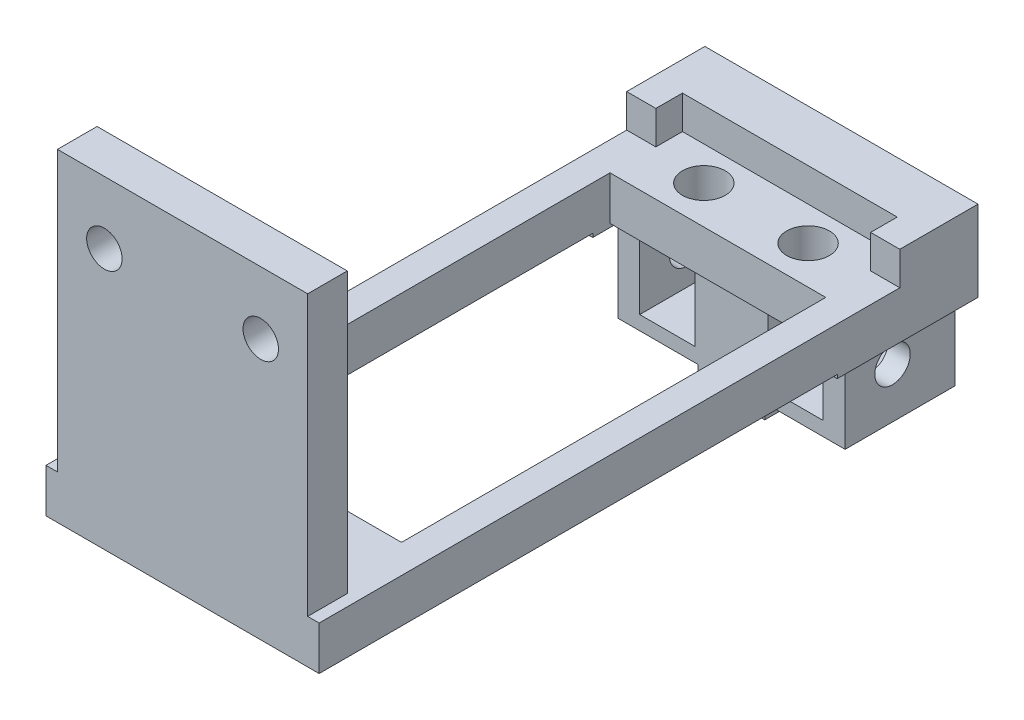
ISO-10303-21;
HEADER;
FILE_DESCRIPTION(('STEP AP214'),'2;1');
FILE_NAME('part.step','',(''),(''),'','','');
FILE_SCHEMA(('AUTOMOTIVE_DESIGN { 1 0 10303 214 1 1 1 1 }'));
ENDSEC;
DATA;
#1=APPLICATION_CONTEXT('core data for automotive mechanical design processes');
#2=APPLICATION_PROTOCOL_DEFINITION('international standard','automotive_design',2000,#1);
#3=PRODUCT_CONTEXT('',#1,'mechanical');
#4=PRODUCT('Part','Part','',(#3));
#5=PRODUCT_RELATED_PRODUCT_CATEGORY('part','',(#4));
#6=PRODUCT_DEFINITION_FORMATION('','',#4);
#7=PRODUCT_DEFINITION_CONTEXT('part definition',#1,'design');
#8=PRODUCT_DEFINITION('design','',#6,#7);
#9=PRODUCT_DEFINITION_SHAPE('','',#8);
#10=(LENGTH_UNIT() NAMED_UNIT(*) SI_UNIT(.MILLI.,.METRE.));
#11=(NAMED_UNIT(*) PLANE_ANGLE_UNIT() SI_UNIT($,.RADIAN.));
#12=(NAMED_UNIT(*) SI_UNIT($,.STERADIAN.) SOLID_ANGLE_UNIT());
#13=UNCERTAINTY_MEASURE_WITH_UNIT(LENGTH_MEASURE(1.E-05),#10,'distance_accuracy_value','');
#14=(GEOMETRIC_REPRESENTATION_CONTEXT(3) GLOBAL_UNCERTAINTY_ASSIGNED_CONTEXT((#13)) GLOBAL_UNIT_ASSIGNED_CONTEXT((#10,
#11,#12)) REPRESENTATION_CONTEXT('',''));
#15=CARTESIAN_POINT('',(0.,0.,0.));
#16=DIRECTION('',(0.,0.,1.));
#17=DIRECTION('',(1.,0.,0.));
#18=AXIS2_PLACEMENT_3D('',#15,#16,#17);
#19=CARTESIAN_POINT('',(0.,48.,-63.2));
#20=DIRECTION('',(0.,-1.,0.));
#21=DIRECTION('',(0.,0.,-1.));
#22=AXIS2_PLACEMENT_3D('',#19,#20,#21);
#23=PLANE('',#22);
#24=DIRECTION('',(-1.,0.,0.));
#25=VECTOR('',#24,1.);
#26=CARTESIAN_POINT('',(0.,48.,-49.7));
#27=LINE('',#26,#25);
#28=CARTESIAN_POINT('',(13.1,48.,-49.7));
#29=VERTEX_POINT('',#28);
#30=CARTESIAN_POINT('',(10.35,48.,-49.7));
#31=VERTEX_POINT('',#30);
#32=EDGE_CURVE('E391',#29,#31,#27,.T.);
#33=ORIENTED_EDGE('',*,*,#32,.F.);
#34=DIRECTION('',(0.,0.,1.));
#35=VECTOR('',#34,1.);
#36=CARTESIAN_POINT('',(13.1,48.,-63.2));
#37=LINE('',#36,#35);
#38=CARTESIAN_POINT('',(13.1,48.,0.));
#39=VERTEX_POINT('',#38);
#40=EDGE_CURVE('E560',#29,#39,#37,.T.);
#41=ORIENTED_EDGE('',*,*,#40,.T.);
#42=DIRECTION('',(-1.,0.,0.));
#43=VECTOR('',#42,1.);
#44=CARTESIAN_POINT('',(0.,48.,0.));
#45=LINE('',#44,#43);
#46=CARTESIAN_POINT('',(-13.1,48.,0.));
#47=VERTEX_POINT('',#46);
#48=EDGE_CURVE('E579',#39,#47,#45,.T.);
#49=ORIENTED_EDGE('',*,*,#48,.T.);
#50=DIRECTION('',(0.,0.,1.));
#51=VECTOR('',#50,1.);
#52=CARTESIAN_POINT('',(-13.1,48.,-63.2));
#53=LINE('',#52,#51);
#54=CARTESIAN_POINT('',(-13.1,48.,-49.7));
#55=VERTEX_POINT('',#54);
#56=EDGE_CURVE('E566',#55,#47,#53,.T.);
#57=ORIENTED_EDGE('',*,*,#56,.F.);
#58=DIRECTION('',(-1.,0.,0.));
#59=VECTOR('',#58,1.);
#60=CARTESIAN_POINT('',(0.,48.,-49.7));
#61=LINE('',#60,#59);
#62=CARTESIAN_POINT('',(-10.35,48.,-49.7));
#63=VERTEX_POINT('',#62);
#64=EDGE_CURVE('E418',#63,#55,#61,.T.);
#65=ORIENTED_EDGE('',*,*,#64,.F.);
#66=DIRECTION('',(0.,0.,-1.));
#67=VECTOR('',#66,1.);
#68=CARTESIAN_POINT('',(-10.35,48.,-63.2));
#69=LINE('',#68,#67);
#70=CARTESIAN_POINT('',(-10.35,48.,-10.65));
#71=VERTEX_POINT('',#70);
#72=EDGE_CURVE('E555',#71,#63,#69,.T.);
#73=ORIENTED_EDGE('',*,*,#72,.F.);
#74=DIRECTION('',(-1.,0.,0.));
#75=VECTOR('',#74,1.);
#76=CARTESIAN_POINT('',(0.,48.,-10.65));
#77=LINE('',#76,#75);
#78=CARTESIAN_POINT('',(10.35,48.,-10.65));
#79=VERTEX_POINT('',#78);
#80=EDGE_CURVE('E553',#79,#71,#77,.T.);
#81=ORIENTED_EDGE('',*,*,#80,.F.);
#82=DIRECTION('',(0.,0.,1.));
#83=VECTOR('',#82,1.);
#84=CARTESIAN_POINT('',(10.35,48.,-63.2));
#85=LINE('',#84,#83);
#86=EDGE_CURVE('E550',#31,#79,#85,.T.);
#87=ORIENTED_EDGE('',*,*,#86,.F.);
#88=EDGE_LOOP('',(#33,#41,#49,#57,#65,#73,#81,#87));
#89=FACE_BOUND('',#88,.T.);
#90=ADVANCED_FACE('F16',(#89),#23,.T.);
#91=CARTESIAN_POINT('',(0.,39.2,-63.2));
#92=DIRECTION('',(0.,-1.,0.));
#93=DIRECTION('',(0.,0.,-1.));
#94=AXIS2_PLACEMENT_3D('',#91,#92,#93);
#95=PLANE('',#94);
#96=DIRECTION('',(0.,0.,-1.));
#97=VECTOR('',#96,1.);
#98=CARTESIAN_POINT('',(-3.2,39.2,-63.2));
#99=LINE('',#98,#97);
#100=CARTESIAN_POINT('',(-3.2,39.2,-52.65));
#101=VERTEX_POINT('',#100);
#102=CARTESIAN_POINT('',(-3.2,39.2,-63.2));
#103=VERTEX_POINT('',#102);
#104=EDGE_CURVE('E611',#101,#103,#99,.T.);
#105=ORIENTED_EDGE('',*,*,#104,.F.);
#106=DIRECTION('',(-1.,0.,0.));
#107=VECTOR('',#106,1.);
#108=CARTESIAN_POINT('',(0.,39.2,-52.65));
#109=LINE('',#108,#107);
#110=CARTESIAN_POINT('',(-10.9,39.2,-52.65));
#111=VERTEX_POINT('',#110);
#112=EDGE_CURVE('E452',#101,#111,#109,.T.);
#113=ORIENTED_EDGE('',*,*,#112,.T.);
#114=DIRECTION('',(0.,0.,1.));
#115=VECTOR('',#114,1.);
#116=CARTESIAN_POINT('',(-10.9,39.2,-63.2));
#117=LINE('',#116,#115);
#118=CARTESIAN_POINT('',(-10.9,39.2,-63.2));
#119=VERTEX_POINT('',#118);
#120=EDGE_CURVE('E446',#119,#111,#117,.T.);
#121=ORIENTED_EDGE('',*,*,#120,.F.);
#122=DIRECTION('',(1.,0.,0.));
#123=VECTOR('',#122,1.);
#124=CARTESIAN_POINT('',(0.,39.2,-63.2));
#125=LINE('',#124,#123);
#126=EDGE_CURVE('E442',#119,#103,#125,.T.);
#127=ORIENTED_EDGE('',*,*,#126,.T.);
#128=EDGE_LOOP('',(#105,#113,#121,#127));
#129=FACE_BOUND('',#128,.T.);
#130=ADVANCED_FACE('F762',(#129),#95,.T.);
#131=CARTESIAN_POINT('',(0.,50.1,0.));
#132=DIRECTION('',(0.,0.,1.));
#133=DIRECTION('',(1.,0.,0.));
#134=AXIS2_PLACEMENT_3D('',#131,#132,#133);
#135=PLANE('',#134);
#136=CARTESIAN_POINT('',(7.5,73.,0.));
#137=DIRECTION('',(0.,0.,1.));
#138=DIRECTION('',(1.,0.,0.));
#139=AXIS2_PLACEMENT_3D('',#136,#137,#138);
#140=CIRCLE('',#139,1.7);
#141=CARTESIAN_POINT('',(9.2,73.,0.));
#142=VERTEX_POINT('',#141);
#143=EDGE_CURVE('E459',#142,#142,#140,.T.);
#144=ORIENTED_EDGE('',*,*,#143,.F.);
#145=EDGE_LOOP('',(#144));
#146=FACE_BOUND('',#145,.T.);
#147=CARTESIAN_POINT('',(-7.5,73.,0.));
#148=DIRECTION('',(0.,0.,1.));
#149=DIRECTION('',(1.,0.,0.));
#150=AXIS2_PLACEMENT_3D('',#147,#148,#149);
#151=CIRCLE('',#150,1.7);
#152=CARTESIAN_POINT('',(-5.8,73.,0.));
#153=VERTEX_POINT('',#152);
#154=EDGE_CURVE('E463',#153,#153,#151,.T.);
#155=ORIENTED_EDGE('',*,*,#154,.F.);
#156=EDGE_LOOP('',(#155));
#157=FACE_BOUND('',#156,.T.);
#158=DIRECTION('',(0.,1.,0.));
#159=VECTOR('',#158,1.);
#160=CARTESIAN_POINT('',(-12.,64.,0.));
#161=LINE('',#160,#159);
#162=CARTESIAN_POINT('',(-12.,52.2,0.));
#163=VERTEX_POINT('',#162);
#164=CARTESIAN_POINT('',(-12.,79.,0.));
#165=VERTEX_POINT('',#164);
#166=EDGE_CURVE('E534',#163,#165,#161,.T.);
#167=ORIENTED_EDGE('',*,*,#166,.F.);
#168=DIRECTION('',(1.,0.,0.));
#169=VECTOR('',#168,1.);
#170=CARTESIAN_POINT('',(0.,52.2,0.));
#171=LINE('',#170,#169);
#172=CARTESIAN_POINT('',(-13.1,52.2,0.));
#173=VERTEX_POINT('',#172);
#174=EDGE_CURVE('E572',#173,#163,#171,.T.);
#175=ORIENTED_EDGE('',*,*,#174,.F.);
#176=DIRECTION('',(0.,1.,0.));
#177=VECTOR('',#176,1.);
#178=CARTESIAN_POINT('',(-13.1,50.1,0.));
#179=LINE('',#178,#177);
#180=EDGE_CURVE('E574',#47,#173,#179,.T.);
#181=ORIENTED_EDGE('',*,*,#180,.F.);
#182=ORIENTED_EDGE('',*,*,#48,.F.);
#183=DIRECTION('',(0.,-1.,0.));
#184=VECTOR('',#183,1.);
#185=CARTESIAN_POINT('',(13.1,50.1,0.));
#186=LINE('',#185,#184);
#187=CARTESIAN_POINT('',(13.1,52.2,0.));
#188=VERTEX_POINT('',#187);
#189=EDGE_CURVE('E567',#188,#39,#186,.T.);
#190=ORIENTED_EDGE('',*,*,#189,.F.);
#191=CARTESIAN_POINT('',(12.,52.2,0.));
#192=VERTEX_POINT('',#191);
#193=EDGE_CURVE('E575',#192,#188,#171,.T.);
#194=ORIENTED_EDGE('',*,*,#193,.F.);
#195=DIRECTION('',(0.,-1.,0.));
#196=VECTOR('',#195,1.);
#197=CARTESIAN_POINT('',(12.,64.,0.));
#198=LINE('',#197,#196);
#199=CARTESIAN_POINT('',(12.,79.,0.));
#200=VERTEX_POINT('',#199);
#201=EDGE_CURVE('E530',#200,#192,#198,.T.);
#202=ORIENTED_EDGE('',*,*,#201,.F.);
#203=DIRECTION('',(1.,0.,0.));
#204=VECTOR('',#203,1.);
#205=CARTESIAN_POINT('',(0.,79.,0.));
#206=LINE('',#205,#204);
#207=EDGE_CURVE('E535',#165,#200,#206,.T.);
#208=ORIENTED_EDGE('',*,*,#207,.F.);
#209=EDGE_LOOP('',(#167,#175,#181,#182,#190,#194,#202,#208));
#210=FACE_BOUND('',#209,.T.);
#211=ADVANCED_FACE('F18',(#146,#157,#210),#135,.T.);
#212=DIRECTION('',(0.,0.,-1.));
#213=VECTOR('',#212,1.);
#214=CARTESIAN_POINT('',(10.35,48.,-63.2));
#215=LINE('',#214,#213);
#216=CARTESIAN_POINT('',(10.35,48.,-51.35));
#217=VERTEX_POINT('',#216);
#218=CARTESIAN_POINT('',(10.35,48.,-52.65));
#219=VERTEX_POINT('',#218);
#220=EDGE_CURVE('E384',#217,#219,#215,.T.);
#221=ORIENTED_EDGE('',*,*,#220,.F.);
#222=DIRECTION('',(1.,0.,0.));
#223=VECTOR('',#222,1.);
#224=CARTESIAN_POINT('',(0.,48.,-51.35));
#225=LINE('',#224,#223);
#226=CARTESIAN_POINT('',(-10.35,48.,-51.35));
#227=VERTEX_POINT('',#226);
#228=EDGE_CURVE('E548',#227,#217,#225,.T.);
#229=ORIENTED_EDGE('',*,*,#228,.F.);
#230=DIRECTION('',(0.,0.,1.));
#231=VECTOR('',#230,1.);
#232=CARTESIAN_POINT('',(-10.35,48.,-63.2));
#233=LINE('',#232,#231);
#234=CARTESIAN_POINT('',(-10.35,48.,-52.65));
#235=VERTEX_POINT('',#234);
#236=EDGE_CURVE('E409',#235,#227,#233,.T.);
#237=ORIENTED_EDGE('',*,*,#236,.F.);
#238=DIRECTION('',(-1.,0.,0.));
#239=VECTOR('',#238,1.);
#240=CARTESIAN_POINT('',(0.,48.,-52.65));
#241=LINE('',#240,#239);
#242=EDGE_CURVE('E456',#219,#235,#241,.T.);
#243=ORIENTED_EDGE('',*,*,#242,.F.);
#244=EDGE_LOOP('',(#221,#229,#237,#243));
#245=FACE_BOUND('',#244,.T.);
#246=ADVANCED_FACE('F766',(#245),#23,.T.);
#247=CARTESIAN_POINT('',(-13.1,50.1,-63.2));
#248=DIRECTION('',(-1.,0.,0.));
#249=DIRECTION('',(0.,0.,1.));
#250=AXIS2_PLACEMENT_3D('',#247,#248,#249);
#251=PLANE('',#250);
#252=DIRECTION('',(0.,-1.,0.));
#253=VECTOR('',#252,1.);
#254=CARTESIAN_POINT('',(-13.1,50.1,-63.2));
#255=LINE('',#254,#253);
#256=CARTESIAN_POINT('',(-13.1,55.4,-63.2));
#257=VERTEX_POINT('',#256);
#258=CARTESIAN_POINT('',(-13.1,47.65,-63.2));
#259=VERTEX_POINT('',#258);
#260=EDGE_CURVE('E557',#257,#259,#255,.T.);
#261=ORIENTED_EDGE('',*,*,#260,.T.);
#262=DIRECTION('',(0.,0.,1.));
#263=VECTOR('',#262,1.);
#264=CARTESIAN_POINT('',(-13.1,47.65,-63.2));
#265=LINE('',#264,#263);
#266=CARTESIAN_POINT('',(-13.1,47.65,-49.7));
#267=VERTEX_POINT('',#266);
#268=EDGE_CURVE('E397',#259,#267,#265,.T.);
#269=ORIENTED_EDGE('',*,*,#268,.T.);
#270=DIRECTION('',(0.,1.,0.));
#271=VECTOR('',#270,1.);
#272=CARTESIAN_POINT('',(-13.1,49.925,-49.7));
#273=LINE('',#272,#271);
#274=EDGE_CURVE('E404',#267,#55,#273,.T.);
#275=ORIENTED_EDGE('',*,*,#274,.T.);
#276=ORIENTED_EDGE('',*,*,#56,.T.);
#277=ORIENTED_EDGE('',*,*,#180,.T.);
#278=DIRECTION('',(0.,0.,1.));
#279=VECTOR('',#278,1.);
#280=CARTESIAN_POINT('',(-13.1,52.2,-63.2));
#281=LINE('',#280,#279);
#282=CARTESIAN_POINT('',(-13.1,52.2,-55.7));
#283=VERTEX_POINT('',#282);
#284=EDGE_CURVE('E564',#283,#173,#281,.T.);
#285=ORIENTED_EDGE('',*,*,#284,.F.);
#286=DIRECTION('',(0.,1.,0.));
#287=VECTOR('',#286,1.);
#288=CARTESIAN_POINT('',(-13.1,53.575,-55.7));
#289=LINE('',#288,#287);
#290=CARTESIAN_POINT('',(-13.1,55.4,-55.7));
#291=VERTEX_POINT('',#290);
#292=EDGE_CURVE('E497',#283,#291,#289,.T.);
#293=ORIENTED_EDGE('',*,*,#292,.T.);
#294=DIRECTION('',(0.,0.,1.));
#295=VECTOR('',#294,1.);
#296=CARTESIAN_POINT('',(-13.1,55.4,-63.2));
#297=LINE('',#296,#295);
#298=EDGE_CURVE('E490',#257,#291,#297,.T.);
#299=ORIENTED_EDGE('',*,*,#298,.F.);
#300=EDGE_LOOP('',(#261,#269,#275,#276,#277,#285,#293,#299));
#301=FACE_BOUND('',#300,.T.);
#302=ADVANCED_FACE('F773',(#301),#251,.T.);
#303=CARTESIAN_POINT('',(0.,52.2,-63.2));
#304=DIRECTION('',(0.,1.,0.));
#305=DIRECTION('',(0.,0.,1.));
#306=AXIS2_PLACEMENT_3D('',#303,#304,#305);
#307=PLANE('',#306);
#308=CARTESIAN_POINT('',(5.,52.2,-55.));
#309=DIRECTION('',(0.,1.,0.));
#310=DIRECTION('',(0.,0.,1.));
#311=AXIS2_PLACEMENT_3D('',#308,#309,#310);
#312=CIRCLE('',#311,2.05);
#313=CARTESIAN_POINT('',(5.,52.2,-52.95));
#314=VERTEX_POINT('',#313);
#315=EDGE_CURVE('E20',#314,#314,#312,.T.);
#316=ORIENTED_EDGE('',*,*,#315,.F.);
#317=EDGE_LOOP('',(#316));
#318=FACE_BOUND('',#317,.T.);
#319=CARTESIAN_POINT('',(5.,52.2,-7.));
#320=DIRECTION('',(0.,1.,0.));
#321=DIRECTION('',(0.,0.,1.));
#322=AXIS2_PLACEMENT_3D('',#319,#320,#321);
#323=CIRCLE('',#322,2.05);
#324=CARTESIAN_POINT('',(5.,52.2,-4.95));
#325=VERTEX_POINT('',#324);
#326=EDGE_CURVE('E674',#325,#325,#323,.T.);
#327=ORIENTED_EDGE('',*,*,#326,.F.);
#328=EDGE_LOOP('',(#327));
#329=FACE_BOUND('',#328,.T.);
#330=CARTESIAN_POINT('',(-5.,52.2,-55.));
#331=DIRECTION('',(0.,1.,0.));
#332=DIRECTION('',(0.,0.,1.));
#333=AXIS2_PLACEMENT_3D('',#330,#331,#332);
#334=CIRCLE('',#333,2.05);
#335=CARTESIAN_POINT('',(-5.,52.2,-52.95));
#336=VERTEX_POINT('',#335);
#337=EDGE_CURVE('E667',#336,#336,#334,.T.);
#338=ORIENTED_EDGE('',*,*,#337,.F.);
#339=EDGE_LOOP('',(#338));
#340=FACE_BOUND('',#339,.T.);
#341=CARTESIAN_POINT('',(-5.,52.2,-7.));
#342=DIRECTION('',(0.,1.,0.));
#343=DIRECTION('',(0.,0.,1.));
#344=AXIS2_PLACEMENT_3D('',#341,#342,#343);
#345=CIRCLE('',#344,2.05);
#346=CARTESIAN_POINT('',(-5.,52.2,-4.95));
#347=VERTEX_POINT('',#346);
#348=EDGE_CURVE('E659',#347,#347,#345,.T.);
#349=ORIENTED_EDGE('',*,*,#348,.F.);
#350=EDGE_LOOP('',(#349));
#351=FACE_BOUND('',#350,.T.);
#352=ORIENTED_EDGE('',*,*,#193,.T.);
#353=DIRECTION('',(0.,0.,1.));
#354=VECTOR('',#353,1.);
#355=CARTESIAN_POINT('',(13.1,52.2,-63.2));
#356=LINE('',#355,#354);
#357=CARTESIAN_POINT('',(13.1,52.2,-55.7));
#358=VERTEX_POINT('',#357);
#359=EDGE_CURVE('E563',#358,#188,#356,.T.);
#360=ORIENTED_EDGE('',*,*,#359,.F.);
#361=DIRECTION('',(1.,0.,0.));
#362=VECTOR('',#361,1.);
#363=CARTESIAN_POINT('',(0.,52.2,-55.7));
#364=LINE('',#363,#362);
#365=CARTESIAN_POINT('',(10.3,52.2,-55.7));
#366=VERTEX_POINT('',#365);
#367=EDGE_CURVE('E483',#366,#358,#364,.T.);
#368=ORIENTED_EDGE('',*,*,#367,.F.);
#369=DIRECTION('',(0.,0.,1.));
#370=VECTOR('',#369,1.);
#371=CARTESIAN_POINT('',(10.3,52.2,-63.2));
#372=LINE('',#371,#370);
#373=CARTESIAN_POINT('',(10.3,52.2,-58.25));
#374=VERTEX_POINT('',#373);
#375=EDGE_CURVE('E477',#374,#366,#372,.T.);
#376=ORIENTED_EDGE('',*,*,#375,.F.);
#377=DIRECTION('',(1.,0.,0.));
#378=VECTOR('',#377,1.);
#379=CARTESIAN_POINT('',(0.,52.2,-58.25));
#380=LINE('',#379,#378);
#381=CARTESIAN_POINT('',(-10.3,52.2,-58.25));
#382=VERTEX_POINT('',#381);
#383=EDGE_CURVE('E597',#382,#374,#380,.T.);
#384=ORIENTED_EDGE('',*,*,#383,.F.);
#385=DIRECTION('',(0.,0.,-1.));
#386=VECTOR('',#385,1.);
#387=CARTESIAN_POINT('',(-10.3,52.2,-63.2));
#388=LINE('',#387,#386);
#389=CARTESIAN_POINT('',(-10.3,52.2,-55.7));
#390=VERTEX_POINT('',#389);
#391=EDGE_CURVE('E499',#390,#382,#388,.T.);
#392=ORIENTED_EDGE('',*,*,#391,.F.);
#393=DIRECTION('',(1.,0.,0.));
#394=VECTOR('',#393,1.);
#395=CARTESIAN_POINT('',(0.,52.2,-55.7));
#396=LINE('',#395,#394);
#397=EDGE_CURVE('E605',#283,#390,#396,.T.);
#398=ORIENTED_EDGE('',*,*,#397,.F.);
#399=ORIENTED_EDGE('',*,*,#284,.T.);
#400=ORIENTED_EDGE('',*,*,#174,.T.);
#401=DIRECTION('',(0.,0.,1.));
#402=VECTOR('',#401,1.);
#403=CARTESIAN_POINT('',(-12.,52.2,-63.2));
#404=LINE('',#403,#402);
#405=CARTESIAN_POINT('',(-12.,52.2,-3.8));
#406=VERTEX_POINT('',#405);
#407=EDGE_CURVE('E596',#406,#163,#404,.T.);
#408=ORIENTED_EDGE('',*,*,#407,.F.);
#409=DIRECTION('',(-1.,0.,0.));
#410=VECTOR('',#409,1.);
#411=CARTESIAN_POINT('',(0.,52.2,-3.8));
#412=LINE('',#411,#410);
#413=CARTESIAN_POINT('',(12.,52.2,-3.8));
#414=VERTEX_POINT('',#413);
#415=EDGE_CURVE('E593',#414,#406,#412,.T.);
#416=ORIENTED_EDGE('',*,*,#415,.F.);
#417=DIRECTION('',(0.,0.,-1.));
#418=VECTOR('',#417,1.);
#419=CARTESIAN_POINT('',(12.,52.2,-63.2));
#420=LINE('',#419,#418);
#421=EDGE_CURVE('E587',#192,#414,#420,.T.);
#422=ORIENTED_EDGE('',*,*,#421,.F.);
#423=EDGE_LOOP('',(#352,#360,#368,#376,#384,#392,#398,#399,#400,#408,#416,#422));
#424=FACE_BOUND('',#423,.T.);
#425=DIRECTION('',(-1.,0.,0.));
#426=VECTOR('',#425,1.);
#427=CARTESIAN_POINT('',(0.,52.2,-51.35));
#428=LINE('',#427,#426);
#429=CARTESIAN_POINT('',(10.35,52.2,-51.35));
#430=VERTEX_POINT('',#429);
#431=CARTESIAN_POINT('',(-10.35,52.2,-51.35));
#432=VERTEX_POINT('',#431);
#433=EDGE_CURVE('E581',#430,#432,#428,.T.);
#434=ORIENTED_EDGE('',*,*,#433,.F.);
#435=DIRECTION('',(0.,0.,-1.));
#436=VECTOR('',#435,1.);
#437=CARTESIAN_POINT('',(10.35,52.2,-63.2));
#438=LINE('',#437,#436);
#439=CARTESIAN_POINT('',(10.35,52.2,-10.65));
#440=VERTEX_POINT('',#439);
#441=EDGE_CURVE('E583',#440,#430,#438,.T.);
#442=ORIENTED_EDGE('',*,*,#441,.F.);
#443=DIRECTION('',(1.,0.,0.));
#444=VECTOR('',#443,1.);
#445=CARTESIAN_POINT('',(0.,52.2,-10.65));
#446=LINE('',#445,#444);
#447=CARTESIAN_POINT('',(-10.35,52.2,-10.65));
#448=VERTEX_POINT('',#447);
#449=EDGE_CURVE('E590',#448,#440,#446,.T.);
#450=ORIENTED_EDGE('',*,*,#449,.F.);
#451=DIRECTION('',(0.,0.,1.));
#452=VECTOR('',#451,1.);
#453=CARTESIAN_POINT('',(-10.35,52.2,-63.2));
#454=LINE('',#453,#452);
#455=EDGE_CURVE('E584',#432,#448,#454,.T.);
#456=ORIENTED_EDGE('',*,*,#455,.F.);
#457=EDGE_LOOP('',(#434,#442,#450,#456));
#458=FACE_BOUND('',#457,.T.);
#459=ADVANCED_FACE('F781',(#318,#329,#340,#351,#424,#458),#307,.T.);
#460=CARTESIAN_POINT('',(0.,50.1,-63.2));
#461=DIRECTION('',(0.,0.,-1.));
#462=DIRECTION('',(-1.,0.,0.));
#463=AXIS2_PLACEMENT_3D('',#460,#461,#462);
#464=PLANE('',#463);
#465=DIRECTION('',(0.,-1.,0.));
#466=VECTOR('',#465,1.);
#467=CARTESIAN_POINT('',(9.25000000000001,50.1,-63.2));
#468=LINE('',#467,#466);
#469=CARTESIAN_POINT('',(9.25,47.9,-63.2));
#470=VERTEX_POINT('',#469);
#471=CARTESIAN_POINT('',(9.25,40.1,-63.2));
#472=VERTEX_POINT('',#471);
#473=EDGE_CURVE('E323',#470,#472,#468,.T.);
#474=ORIENTED_EDGE('',*,*,#473,.F.);
#475=DIRECTION('',(1.,0.,0.));
#476=VECTOR('',#475,1.);
#477=CARTESIAN_POINT('',(0.,47.9,-63.2));
#478=LINE('',#477,#476);
#479=CARTESIAN_POINT('',(3.05,47.9,-63.2));
#480=VERTEX_POINT('',#479);
#481=EDGE_CURVE('E318',#480,#470,#478,.T.);
#482=ORIENTED_EDGE('',*,*,#481,.F.);
#483=DIRECTION('',(0.,1.,0.));
#484=VECTOR('',#483,1.);
#485=CARTESIAN_POINT('',(3.05,50.1,-63.2));
#486=LINE('',#485,#484);
#487=CARTESIAN_POINT('',(3.05,40.1,-63.2));
#488=VERTEX_POINT('',#487);
#489=EDGE_CURVE('E310',#488,#480,#486,.T.);
#490=ORIENTED_EDGE('',*,*,#489,.F.);
#491=DIRECTION('',(-1.,0.,0.));
#492=VECTOR('',#491,1.);
#493=CARTESIAN_POINT('',(0.,40.1,-63.2));
#494=LINE('',#493,#492);
#495=EDGE_CURVE('E294',#472,#488,#494,.T.);
#496=ORIENTED_EDGE('',*,*,#495,.F.);
#497=EDGE_LOOP('',(#474,#482,#490,#496));
#498=FACE_BOUND('',#497,.T.);
#499=DIRECTION('',(0.,-1.,0.));
#500=VECTOR('',#499,1.);
#501=CARTESIAN_POINT('',(-3.05,50.1,-63.2));
#502=LINE('',#501,#500);
#503=CARTESIAN_POINT('',(-3.05,47.9,-63.2));
#504=VERTEX_POINT('',#503);
#505=CARTESIAN_POINT('',(-3.05,40.1,-63.2));
#506=VERTEX_POINT('',#505);
#507=EDGE_CURVE('E352',#504,#506,#502,.T.);
#508=ORIENTED_EDGE('',*,*,#507,.F.);
#509=DIRECTION('',(1.,0.,0.));
#510=VECTOR('',#509,1.);
#511=CARTESIAN_POINT('',(0.,47.9,-63.2));
#512=LINE('',#511,#510);
#513=CARTESIAN_POINT('',(-9.25000000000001,47.9,-63.2));
#514=VERTEX_POINT('',#513);
#515=EDGE_CURVE('E351',#514,#504,#512,.T.);
#516=ORIENTED_EDGE('',*,*,#515,.F.);
#517=DIRECTION('',(0.,1.,0.));
#518=VECTOR('',#517,1.);
#519=CARTESIAN_POINT('',(-9.25000000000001,50.1,-63.2));
#520=LINE('',#519,#518);
#521=CARTESIAN_POINT('',(-9.25,40.1,-63.2));
#522=VERTEX_POINT('',#521);
#523=EDGE_CURVE('E356',#522,#514,#520,.T.);
#524=ORIENTED_EDGE('',*,*,#523,.F.);
#525=DIRECTION('',(-1.,0.,0.));
#526=VECTOR('',#525,1.);
#527=CARTESIAN_POINT('',(0.,40.1,-63.2));
#528=LINE('',#527,#526);
#529=EDGE_CURVE('E350',#506,#522,#528,.T.);
#530=ORIENTED_EDGE('',*,*,#529,.F.);
#531=EDGE_LOOP('',(#508,#516,#524,#530));
#532=FACE_BOUND('',#531,.T.);
#533=DIRECTION('',(0.,1.,0.));
#534=VECTOR('',#533,1.);
#535=CARTESIAN_POINT('',(13.1,50.1,-63.2));
#536=LINE('',#535,#534);
#537=CARTESIAN_POINT('',(13.1,47.65,-63.2));
#538=VERTEX_POINT('',#537);
#539=CARTESIAN_POINT('',(13.1,55.4,-63.2));
#540=VERTEX_POINT('',#539);
#541=EDGE_CURVE('E559',#538,#540,#536,.T.);
#542=ORIENTED_EDGE('',*,*,#541,.F.);
#543=DIRECTION('',(1.,0.,0.));
#544=VECTOR('',#543,1.);
#545=CARTESIAN_POINT('',(11.725,47.65,-63.2));
#546=LINE('',#545,#544);
#547=CARTESIAN_POINT('',(10.9,47.65,-63.2));
#548=VERTEX_POINT('',#547);
#549=EDGE_CURVE('E369',#548,#538,#546,.T.);
#550=ORIENTED_EDGE('',*,*,#549,.F.);
#551=DIRECTION('',(0.,1.,0.));
#552=VECTOR('',#551,1.);
#553=CARTESIAN_POINT('',(10.9,44.65,-63.2));
#554=LINE('',#553,#552);
#555=CARTESIAN_POINT('',(10.9,39.2,-63.2));
#556=VERTEX_POINT('',#555);
#557=EDGE_CURVE('E511',#556,#548,#554,.T.);
#558=ORIENTED_EDGE('',*,*,#557,.F.);
#559=CARTESIAN_POINT('',(3.2,39.2,-63.2));
#560=VERTEX_POINT('',#559);
#561=EDGE_CURVE('E439',#560,#556,#125,.T.);
#562=ORIENTED_EDGE('',*,*,#561,.F.);
#563=DIRECTION('',(0.,1.,0.));
#564=VECTOR('',#563,1.);
#565=CARTESIAN_POINT('',(3.2,43.5,-63.2));
#566=LINE('',#565,#564);
#567=CARTESIAN_POINT('',(3.2,37.8,-63.2));
#568=VERTEX_POINT('',#567);
#569=EDGE_CURVE('E421',#568,#560,#566,.T.);
#570=ORIENTED_EDGE('',*,*,#569,.F.);
#571=DIRECTION('',(1.,0.,0.));
#572=VECTOR('',#571,1.);
#573=CARTESIAN_POINT('',(0.,37.8,-63.2));
#574=LINE('',#573,#572);
#575=CARTESIAN_POINT('',(-3.2,37.8,-63.2));
#576=VERTEX_POINT('',#575);
#577=EDGE_CURVE('E420',#576,#568,#574,.T.);
#578=ORIENTED_EDGE('',*,*,#577,.F.);
#579=DIRECTION('',(0.,-1.,0.));
#580=VECTOR('',#579,1.);
#581=CARTESIAN_POINT('',(-3.2,43.5,-63.2));
#582=LINE('',#581,#580);
#583=EDGE_CURVE('E425',#103,#576,#582,.T.);
#584=ORIENTED_EDGE('',*,*,#583,.F.);
#585=ORIENTED_EDGE('',*,*,#126,.F.);
#586=DIRECTION('',(0.,-1.,0.));
#587=VECTOR('',#586,1.);
#588=CARTESIAN_POINT('',(-10.9,44.65,-63.2));
#589=LINE('',#588,#587);
#590=CARTESIAN_POINT('',(-10.9,47.65,-63.2));
#591=VERTEX_POINT('',#590);
#592=EDGE_CURVE('E515',#591,#119,#589,.T.);
#593=ORIENTED_EDGE('',*,*,#592,.F.);
#594=DIRECTION('',(1.,0.,0.));
#595=VECTOR('',#594,1.);
#596=CARTESIAN_POINT('',(-11.725,47.65,-63.2));
#597=LINE('',#596,#595);
#598=EDGE_CURVE('E393',#259,#591,#597,.T.);
#599=ORIENTED_EDGE('',*,*,#598,.F.);
#600=ORIENTED_EDGE('',*,*,#260,.F.);
#601=DIRECTION('',(-1.,0.,0.));
#602=VECTOR('',#601,1.);
#603=CARTESIAN_POINT('',(0.,55.4,-63.2));
#604=LINE('',#603,#602);
#605=EDGE_CURVE('E498',#540,#257,#604,.T.);
#606=ORIENTED_EDGE('',*,*,#605,.F.);
#607=EDGE_LOOP('',(#542,#550,#558,#562,#570,#578,#584,#585,#593,#599,#600,#606));
#608=FACE_BOUND('',#607,.T.);
#609=ADVANCED_FACE('F316',(#498,#532,#608),#464,.T.);
#610=CARTESIAN_POINT('',(13.1,50.1,-63.2));
#611=DIRECTION('',(1.,0.,0.));
#612=DIRECTION('',(0.,0.,-1.));
#613=AXIS2_PLACEMENT_3D('',#610,#611,#612);
#614=PLANE('',#613);
#615=DIRECTION('',(0.,-1.,0.));
#616=VECTOR('',#615,1.);
#617=CARTESIAN_POINT('',(13.1,53.575,-55.7));
#618=LINE('',#617,#616);
#619=CARTESIAN_POINT('',(13.1,55.4,-55.7));
#620=VERTEX_POINT('',#619);
#621=EDGE_CURVE('E471',#620,#358,#618,.T.);
#622=ORIENTED_EDGE('',*,*,#621,.T.);
#623=ORIENTED_EDGE('',*,*,#359,.T.);
#624=ORIENTED_EDGE('',*,*,#189,.T.);
#625=ORIENTED_EDGE('',*,*,#40,.F.);
#626=DIRECTION('',(0.,-1.,0.));
#627=VECTOR('',#626,1.);
#628=CARTESIAN_POINT('',(13.1,49.925,-49.7));
#629=LINE('',#628,#627);
#630=CARTESIAN_POINT('',(13.1,47.65,-49.7));
#631=VERTEX_POINT('',#630);
#632=EDGE_CURVE('E380',#29,#631,#629,.T.);
#633=ORIENTED_EDGE('',*,*,#632,.T.);
#634=DIRECTION('',(0.,0.,1.));
#635=VECTOR('',#634,1.);
#636=CARTESIAN_POINT('',(13.1,47.65,-63.2));
#637=LINE('',#636,#635);
#638=EDGE_CURVE('E375',#538,#631,#637,.T.);
#639=ORIENTED_EDGE('',*,*,#638,.F.);
#640=ORIENTED_EDGE('',*,*,#541,.T.);
#641=DIRECTION('',(0.,0.,1.));
#642=VECTOR('',#641,1.);
#643=CARTESIAN_POINT('',(13.1,55.4,-63.2));
#644=LINE('',#643,#642);
#645=EDGE_CURVE('E470',#540,#620,#644,.T.);
#646=ORIENTED_EDGE('',*,*,#645,.T.);
#647=EDGE_LOOP('',(#622,#623,#624,#625,#633,#639,#640,#646));
#648=FACE_BOUND('',#647,.T.);
#649=ADVANCED_FACE('F845',(#648),#614,.T.);
#650=CARTESIAN_POINT('',(0.,50.1,-10.65));
#651=DIRECTION('',(0.,0.,1.));
#652=DIRECTION('',(1.,0.,0.));
#653=AXIS2_PLACEMENT_3D('',#650,#651,#652);
#654=PLANE('',#653);
#655=ORIENTED_EDGE('',*,*,#80,.T.);
#656=DIRECTION('',(0.,1.,0.));
#657=VECTOR('',#656,1.);
#658=CARTESIAN_POINT('',(-10.35,50.1,-10.65));
#659=LINE('',#658,#657);
#660=EDGE_CURVE('E542',#71,#448,#659,.T.);
#661=ORIENTED_EDGE('',*,*,#660,.T.);
#662=ORIENTED_EDGE('',*,*,#449,.T.);
#663=DIRECTION('',(0.,-1.,0.));
#664=VECTOR('',#663,1.);
#665=CARTESIAN_POINT('',(10.35,50.1,-10.65));
#666=LINE('',#665,#664);
#667=EDGE_CURVE('E539',#440,#79,#666,.T.);
#668=ORIENTED_EDGE('',*,*,#667,.T.);
#669=EDGE_LOOP('',(#655,#661,#662,#668));
#670=FACE_BOUND('',#669,.T.);
#671=ADVANCED_FACE('F802',(#670),#654,.F.);
#672=CARTESIAN_POINT('',(-10.35,50.1,-51.35));
#673=DIRECTION('',(-1.,0.,0.));
#674=DIRECTION('',(0.,0.,1.));
#675=AXIS2_PLACEMENT_3D('',#672,#673,#674);
#676=PLANE('',#675);
#677=ORIENTED_EDGE('',*,*,#72,.T.);
#678=DIRECTION('',(0.,-1.,0.));
#679=VECTOR('',#678,1.);
#680=CARTESIAN_POINT('',(-10.35,49.925,-49.7));
#681=LINE('',#680,#679);
#682=CARTESIAN_POINT('',(-10.35,47.65,-49.7));
#683=VERTEX_POINT('',#682);
#684=EDGE_CURVE('E401',#63,#683,#681,.T.);
#685=ORIENTED_EDGE('',*,*,#684,.T.);
#686=DIRECTION('',(0.,0.,1.));
#687=VECTOR('',#686,1.);
#688=CARTESIAN_POINT('',(-10.35,47.65,-63.2));
#689=LINE('',#688,#687);
#690=CARTESIAN_POINT('',(-10.35,47.65,-52.65));
#691=VERTEX_POINT('',#690);
#692=EDGE_CURVE('E400',#691,#683,#689,.T.);
#693=ORIENTED_EDGE('',*,*,#692,.F.);
#694=DIRECTION('',(0.,1.,0.));
#695=VECTOR('',#694,1.);
#696=CARTESIAN_POINT('',(-10.35,45.7,-52.65));
#697=LINE('',#696,#695);
#698=EDGE_CURVE('E613',#691,#235,#697,.T.);
#699=ORIENTED_EDGE('',*,*,#698,.T.);
#700=ORIENTED_EDGE('',*,*,#236,.T.);
#701=DIRECTION('',(0.,-1.,0.));
#702=VECTOR('',#701,1.);
#703=CARTESIAN_POINT('',(-10.35,50.1,-51.35));
#704=LINE('',#703,#702);
#705=EDGE_CURVE('E536',#432,#227,#704,.T.);
#706=ORIENTED_EDGE('',*,*,#705,.F.);
#707=ORIENTED_EDGE('',*,*,#455,.T.);
#708=ORIENTED_EDGE('',*,*,#660,.F.);
#709=EDGE_LOOP('',(#677,#685,#693,#699,#700,#706,#707,#708));
#710=FACE_BOUND('',#709,.T.);
#711=ADVANCED_FACE('F800',(#710),#676,.F.);
#712=CARTESIAN_POINT('',(0.,50.1,-51.35));
#713=DIRECTION('',(0.,0.,-1.));
#714=DIRECTION('',(-1.,0.,0.));
#715=AXIS2_PLACEMENT_3D('',#712,#713,#714);
#716=PLANE('',#715);
#717=ORIENTED_EDGE('',*,*,#228,.T.);
#718=DIRECTION('',(0.,1.,0.));
#719=VECTOR('',#718,1.);
#720=CARTESIAN_POINT('',(10.35,50.1,-51.35));
#721=LINE('',#720,#719);
#722=EDGE_CURVE('E540',#217,#430,#721,.T.);
#723=ORIENTED_EDGE('',*,*,#722,.T.);
#724=ORIENTED_EDGE('',*,*,#433,.T.);
#725=ORIENTED_EDGE('',*,*,#705,.T.);
#726=EDGE_LOOP('',(#717,#723,#724,#725));
#727=FACE_BOUND('',#726,.T.);
#728=ADVANCED_FACE('F792',(#727),#716,.F.);
#729=CARTESIAN_POINT('',(10.35,50.1,-51.35));
#730=DIRECTION('',(1.,0.,0.));
#731=DIRECTION('',(0.,0.,-1.));
#732=AXIS2_PLACEMENT_3D('',#729,#730,#731);
#733=PLANE('',#732);
#734=ORIENTED_EDGE('',*,*,#441,.T.);
#735=ORIENTED_EDGE('',*,*,#722,.F.);
#736=ORIENTED_EDGE('',*,*,#220,.T.);
#737=DIRECTION('',(0.,-1.,0.));
#738=VECTOR('',#737,1.);
#739=CARTESIAN_POINT('',(10.35,45.7,-52.65));
#740=LINE('',#739,#738);
#741=CARTESIAN_POINT('',(10.35,47.65,-52.65));
#742=VERTEX_POINT('',#741);
#743=EDGE_CURVE('E619',#219,#742,#740,.T.);
#744=ORIENTED_EDGE('',*,*,#743,.T.);
#745=DIRECTION('',(0.,0.,1.));
#746=VECTOR('',#745,1.);
#747=CARTESIAN_POINT('',(10.35,47.65,-63.2));
#748=LINE('',#747,#746);
#749=CARTESIAN_POINT('',(10.35,47.65,-49.7));
#750=VERTEX_POINT('',#749);
#751=EDGE_CURVE('E374',#742,#750,#748,.T.);
#752=ORIENTED_EDGE('',*,*,#751,.T.);
#753=DIRECTION('',(0.,1.,0.));
#754=VECTOR('',#753,1.);
#755=CARTESIAN_POINT('',(10.35,49.925,-49.7));
#756=LINE('',#755,#754);
#757=EDGE_CURVE('E377',#750,#31,#756,.T.);
#758=ORIENTED_EDGE('',*,*,#757,.T.);
#759=ORIENTED_EDGE('',*,*,#86,.T.);
#760=ORIENTED_EDGE('',*,*,#667,.F.);
#761=EDGE_LOOP('',(#734,#735,#736,#744,#752,#758,#759,#760));
#762=FACE_BOUND('',#761,.T.);
#763=ADVANCED_FACE('F787',(#762),#733,.F.);
#764=CARTESIAN_POINT('',(-12.,64.,-3.8));
#765=DIRECTION('',(-1.,0.,0.));
#766=DIRECTION('',(0.,0.,1.));
#767=AXIS2_PLACEMENT_3D('',#764,#765,#766);
#768=PLANE('',#767);
#769=DIRECTION('',(0.,-1.,0.));
#770=VECTOR('',#769,1.);
#771=CARTESIAN_POINT('',(-12.,64.,-3.8));
#772=LINE('',#771,#770);
#773=CARTESIAN_POINT('',(-12.,79.,-3.8));
#774=VERTEX_POINT('',#773);
#775=EDGE_CURVE('E512',#774,#406,#772,.T.);
#776=ORIENTED_EDGE('',*,*,#775,.T.);
#777=ORIENTED_EDGE('',*,*,#407,.T.);
#778=ORIENTED_EDGE('',*,*,#166,.T.);
#779=DIRECTION('',(0.,0.,1.));
#780=VECTOR('',#779,1.);
#781=CARTESIAN_POINT('',(-12.,79.,-3.8));
#782=LINE('',#781,#780);
#783=EDGE_CURVE('E528',#774,#165,#782,.T.);
#784=ORIENTED_EDGE('',*,*,#783,.F.);
#785=EDGE_LOOP('',(#776,#777,#778,#784));
#786=FACE_BOUND('',#785,.T.);
#787=ADVANCED_FACE('F942',(#786),#768,.T.);
#788=CARTESIAN_POINT('',(0.,79.,-3.8));
#789=DIRECTION('',(0.,1.,0.));
#790=DIRECTION('',(0.,0.,1.));
#791=AXIS2_PLACEMENT_3D('',#788,#789,#790);
#792=PLANE('',#791);
#793=ORIENTED_EDGE('',*,*,#783,.T.);
#794=ORIENTED_EDGE('',*,*,#207,.T.);
#795=DIRECTION('',(0.,0.,1.));
#796=VECTOR('',#795,1.);
#797=CARTESIAN_POINT('',(12.,79.,-3.8));
#798=LINE('',#797,#796);
#799=CARTESIAN_POINT('',(12.,79.,-3.8));
#800=VERTEX_POINT('',#799);
#801=EDGE_CURVE('E517',#800,#200,#798,.T.);
#802=ORIENTED_EDGE('',*,*,#801,.F.);
#803=DIRECTION('',(-1.,0.,0.));
#804=VECTOR('',#803,1.);
#805=CARTESIAN_POINT('',(0.,79.,-3.8));
#806=LINE('',#805,#804);
#807=EDGE_CURVE('E518',#800,#774,#806,.T.);
#808=ORIENTED_EDGE('',*,*,#807,.T.);
#809=EDGE_LOOP('',(#793,#794,#802,#808));
#810=FACE_BOUND('',#809,.T.);
#811=ADVANCED_FACE('F934',(#810),#792,.T.);
#812=CARTESIAN_POINT('',(0.,64.,-3.8));
#813=DIRECTION('',(0.,0.,-1.));
#814=DIRECTION('',(-1.,0.,0.));
#815=AXIS2_PLACEMENT_3D('',#812,#813,#814);
#816=PLANE('',#815);
#817=CARTESIAN_POINT('',(7.5,73.,-3.8));
#818=DIRECTION('',(0.,0.,-1.));
#819=DIRECTION('',(-1.,0.,0.));
#820=AXIS2_PLACEMENT_3D('',#817,#818,#819);
#821=CIRCLE('',#820,1.7);
#822=CARTESIAN_POINT('',(5.8,73.,-3.8));
#823=VERTEX_POINT('',#822);
#824=EDGE_CURVE('E457',#823,#823,#821,.T.);
#825=ORIENTED_EDGE('',*,*,#824,.F.);
#826=EDGE_LOOP('',(#825));
#827=FACE_BOUND('',#826,.T.);
#828=CARTESIAN_POINT('',(-7.5,73.,-3.8));
#829=DIRECTION('',(0.,0.,-1.));
#830=DIRECTION('',(-1.,0.,0.));
#831=AXIS2_PLACEMENT_3D('',#828,#829,#830);
#832=CIRCLE('',#831,1.7);
#833=CARTESIAN_POINT('',(-9.2,73.,-3.8));
#834=VERTEX_POINT('',#833);
#835=EDGE_CURVE('E462',#834,#834,#832,.T.);
#836=ORIENTED_EDGE('',*,*,#835,.F.);
#837=EDGE_LOOP('',(#836));
#838=FACE_BOUND('',#837,.T.);
#839=DIRECTION('',(0.,1.,0.));
#840=VECTOR('',#839,1.);
#841=CARTESIAN_POINT('',(12.,64.,-3.8));
#842=LINE('',#841,#840);
#843=EDGE_CURVE('E516',#414,#800,#842,.T.);
#844=ORIENTED_EDGE('',*,*,#843,.F.);
#845=ORIENTED_EDGE('',*,*,#415,.T.);
#846=ORIENTED_EDGE('',*,*,#775,.F.);
#847=ORIENTED_EDGE('',*,*,#807,.F.);
#848=EDGE_LOOP('',(#844,#845,#846,#847));
#849=FACE_BOUND('',#848,.T.);
#850=ADVANCED_FACE('F935',(#827,#838,#849),#816,.T.);
#851=CARTESIAN_POINT('',(12.,64.,-3.8));
#852=DIRECTION('',(1.,0.,0.));
#853=DIRECTION('',(0.,0.,-1.));
#854=AXIS2_PLACEMENT_3D('',#851,#852,#853);
#855=PLANE('',#854);
#856=ORIENTED_EDGE('',*,*,#201,.T.);
#857=ORIENTED_EDGE('',*,*,#421,.T.);
#858=ORIENTED_EDGE('',*,*,#843,.T.);
#859=ORIENTED_EDGE('',*,*,#801,.T.);
#860=EDGE_LOOP('',(#856,#857,#858,#859));
#861=FACE_BOUND('',#860,.T.);
#862=ADVANCED_FACE('F929',(#861),#855,.T.);
#863=CARTESIAN_POINT('',(-10.9,44.65,-63.2));
#864=DIRECTION('',(-1.,0.,0.));
#865=DIRECTION('',(0.,0.,1.));
#866=AXIS2_PLACEMENT_3D('',#863,#864,#865);
#867=PLANE('',#866);
#868=CARTESIAN_POINT('',(-10.9,44.,-57.2));
#869=DIRECTION('',(-1.,0.,0.));
#870=DIRECTION('',(0.,0.,1.));
#871=AXIS2_PLACEMENT_3D('',#868,#869,#870);
#872=CIRCLE('',#871,1.7);
#873=CARTESIAN_POINT('',(-10.9,44.,-55.5));
#874=VERTEX_POINT('',#873);
#875=EDGE_CURVE('E717',#874,#874,#872,.T.);
#876=ORIENTED_EDGE('',*,*,#875,.F.);
#877=EDGE_LOOP('',(#876));
#878=FACE_BOUND('',#877,.T.);
#879=DIRECTION('',(0.,0.,1.));
#880=VECTOR('',#879,1.);
#881=CARTESIAN_POINT('',(-10.9,47.65,-63.2));
#882=LINE('',#881,#880);
#883=CARTESIAN_POINT('',(-10.9,47.65,-52.65));
#884=VERTEX_POINT('',#883);
#885=EDGE_CURVE('E414',#591,#884,#882,.T.);
#886=ORIENTED_EDGE('',*,*,#885,.F.);
#887=ORIENTED_EDGE('',*,*,#592,.T.);
#888=ORIENTED_EDGE('',*,*,#120,.T.);
#889=DIRECTION('',(0.,1.,0.));
#890=VECTOR('',#889,1.);
#891=CARTESIAN_POINT('',(-10.9,45.7,-52.65));
#892=LINE('',#891,#890);
#893=EDGE_CURVE('E451',#111,#884,#892,.T.);
#894=ORIENTED_EDGE('',*,*,#893,.T.);
#895=EDGE_LOOP('',(#886,#887,#888,#894));
#896=FACE_BOUND('',#895,.T.);
#897=ADVANCED_FACE('F825',(#878,#896),#867,.T.);
#898=CARTESIAN_POINT('',(10.9,44.65,-63.2));
#899=DIRECTION('',(1.,0.,0.));
#900=DIRECTION('',(0.,0.,-1.));
#901=AXIS2_PLACEMENT_3D('',#898,#899,#900);
#902=PLANE('',#901);
#903=CARTESIAN_POINT('',(10.9,44.,-57.2));
#904=DIRECTION('',(1.,0.,0.));
#905=DIRECTION('',(0.,0.,-1.));
#906=AXIS2_PLACEMENT_3D('',#903,#904,#905);
#907=CIRCLE('',#906,1.7);
#908=CARTESIAN_POINT('',(10.9,44.,-58.9));
#909=VERTEX_POINT('',#908);
#910=EDGE_CURVE('E712',#909,#909,#907,.T.);
#911=ORIENTED_EDGE('',*,*,#910,.F.);
#912=EDGE_LOOP('',(#911));
#913=FACE_BOUND('',#912,.T.);
#914=DIRECTION('',(0.,0.,-1.));
#915=VECTOR('',#914,1.);
#916=CARTESIAN_POINT('',(10.9,47.65,-63.2));
#917=LINE('',#916,#915);
#918=CARTESIAN_POINT('',(10.9,47.65,-52.65));
#919=VERTEX_POINT('',#918);
#920=EDGE_CURVE('E389',#919,#548,#917,.T.);
#921=ORIENTED_EDGE('',*,*,#920,.F.);
#922=DIRECTION('',(0.,-1.,0.));
#923=VECTOR('',#922,1.);
#924=CARTESIAN_POINT('',(10.9,45.7,-52.65));
#925=LINE('',#924,#923);
#926=CARTESIAN_POINT('',(10.9,39.2,-52.65));
#927=VERTEX_POINT('',#926);
#928=EDGE_CURVE('E448',#919,#927,#925,.T.);
#929=ORIENTED_EDGE('',*,*,#928,.T.);
#930=DIRECTION('',(0.,0.,1.));
#931=VECTOR('',#930,1.);
#932=CARTESIAN_POINT('',(10.9,39.2,-63.2));
#933=LINE('',#932,#931);
#934=EDGE_CURVE('E444',#556,#927,#933,.T.);
#935=ORIENTED_EDGE('',*,*,#934,.F.);
#936=ORIENTED_EDGE('',*,*,#557,.T.);
#937=EDGE_LOOP('',(#921,#929,#935,#936));
#938=FACE_BOUND('',#937,.T.);
#939=ADVANCED_FACE('F869',(#913,#938),#902,.T.);
#940=CARTESIAN_POINT('',(0.,53.575,-58.25));
#941=DIRECTION('',(0.,0.,1.));
#942=DIRECTION('',(1.,0.,0.));
#943=AXIS2_PLACEMENT_3D('',#940,#941,#942);
#944=PLANE('',#943);
#945=DIRECTION('',(0.,1.,0.));
#946=VECTOR('',#945,1.);
#947=CARTESIAN_POINT('',(-10.3,53.575,-58.25));
#948=LINE('',#947,#946);
#949=CARTESIAN_POINT('',(-10.3,55.4,-58.25));
#950=VERTEX_POINT('',#949);
#951=EDGE_CURVE('E508',#382,#950,#948,.T.);
#952=ORIENTED_EDGE('',*,*,#951,.F.);
#953=ORIENTED_EDGE('',*,*,#383,.T.);
#954=DIRECTION('',(0.,-1.,0.));
#955=VECTOR('',#954,1.);
#956=CARTESIAN_POINT('',(10.3,53.575,-58.25));
#957=LINE('',#956,#955);
#958=CARTESIAN_POINT('',(10.3,55.4,-58.25));
#959=VERTEX_POINT('',#958);
#960=EDGE_CURVE('E504',#959,#374,#957,.T.);
#961=ORIENTED_EDGE('',*,*,#960,.F.);
#962=DIRECTION('',(1.,0.,0.));
#963=VECTOR('',#962,1.);
#964=CARTESIAN_POINT('',(0.,55.4,-58.25));
#965=LINE('',#964,#963);
#966=EDGE_CURVE('E506',#950,#959,#965,.T.);
#967=ORIENTED_EDGE('',*,*,#966,.F.);
#968=EDGE_LOOP('',(#952,#953,#961,#967));
#969=FACE_BOUND('',#968,.T.);
#970=ADVANCED_FACE('F921',(#969),#944,.T.);
#971=CARTESIAN_POINT('',(0.,55.4,-63.2));
#972=DIRECTION('',(0.,1.,0.));
#973=DIRECTION('',(0.,0.,1.));
#974=AXIS2_PLACEMENT_3D('',#971,#972,#973);
#975=PLANE('',#974);
#976=ORIENTED_EDGE('',*,*,#605,.T.);
#977=ORIENTED_EDGE('',*,*,#298,.T.);
#978=DIRECTION('',(1.,0.,0.));
#979=VECTOR('',#978,1.);
#980=CARTESIAN_POINT('',(-11.7,55.4,-55.7));
#981=LINE('',#980,#979);
#982=CARTESIAN_POINT('',(-10.3,55.4,-55.7));
#983=VERTEX_POINT('',#982);
#984=EDGE_CURVE('E492',#291,#983,#981,.T.);
#985=ORIENTED_EDGE('',*,*,#984,.T.);
#986=DIRECTION('',(0.,0.,1.));
#987=VECTOR('',#986,1.);
#988=CARTESIAN_POINT('',(-10.3,55.4,-63.2));
#989=LINE('',#988,#987);
#990=EDGE_CURVE('E484',#950,#983,#989,.T.);
#991=ORIENTED_EDGE('',*,*,#990,.F.);
#992=ORIENTED_EDGE('',*,*,#966,.T.);
#993=DIRECTION('',(0.,0.,1.));
#994=VECTOR('',#993,1.);
#995=CARTESIAN_POINT('',(10.3,55.4,-63.2));
#996=LINE('',#995,#994);
#997=CARTESIAN_POINT('',(10.3,55.4,-55.7));
#998=VERTEX_POINT('',#997);
#999=EDGE_CURVE('E468',#959,#998,#996,.T.);
#1000=ORIENTED_EDGE('',*,*,#999,.T.);
#1001=DIRECTION('',(1.,0.,0.));
#1002=VECTOR('',#1001,1.);
#1003=CARTESIAN_POINT('',(11.7,55.4,-55.7));
#1004=LINE('',#1003,#1002);
#1005=EDGE_CURVE('E478',#998,#620,#1004,.T.);
#1006=ORIENTED_EDGE('',*,*,#1005,.T.);
#1007=ORIENTED_EDGE('',*,*,#645,.F.);
#1008=EDGE_LOOP('',(#976,#977,#985,#991,#992,#1000,#1006,#1007));
#1009=FACE_BOUND('',#1008,.T.);
#1010=ADVANCED_FACE('F862',(#1009),#975,.T.);
#1011=CARTESIAN_POINT('',(-10.3,53.575,-63.2));
#1012=DIRECTION('',(1.,0.,0.));
#1013=DIRECTION('',(0.,0.,-1.));
#1014=AXIS2_PLACEMENT_3D('',#1011,#1012,#1013);
#1015=PLANE('',#1014);
#1016=DIRECTION('',(0.,-1.,0.));
#1017=VECTOR('',#1016,1.);
#1018=CARTESIAN_POINT('',(-10.3,53.575,-55.7));
#1019=LINE('',#1018,#1017);
#1020=EDGE_CURVE('E489',#983,#390,#1019,.T.);
#1021=ORIENTED_EDGE('',*,*,#1020,.T.);
#1022=ORIENTED_EDGE('',*,*,#391,.T.);
#1023=ORIENTED_EDGE('',*,*,#951,.T.);
#1024=ORIENTED_EDGE('',*,*,#990,.T.);
#1025=EDGE_LOOP('',(#1021,#1022,#1023,#1024));
#1026=FACE_BOUND('',#1025,.T.);
#1027=ADVANCED_FACE('F863',(#1026),#1015,.T.);
#1028=CARTESIAN_POINT('',(-11.7,53.575,-55.7));
#1029=DIRECTION('',(0.,0.,1.));
#1030=DIRECTION('',(1.,0.,0.));
#1031=AXIS2_PLACEMENT_3D('',#1028,#1029,#1030);
#1032=PLANE('',#1031);
#1033=ORIENTED_EDGE('',*,*,#292,.F.);
#1034=ORIENTED_EDGE('',*,*,#397,.T.);
#1035=ORIENTED_EDGE('',*,*,#1020,.F.);
#1036=ORIENTED_EDGE('',*,*,#984,.F.);
#1037=EDGE_LOOP('',(#1033,#1034,#1035,#1036));
#1038=FACE_BOUND('',#1037,.T.);
#1039=ADVANCED_FACE('F860',(#1038),#1032,.T.);
#1040=CARTESIAN_POINT('',(11.7,53.575,-55.7));
#1041=DIRECTION('',(0.,0.,1.));
#1042=DIRECTION('',(1.,0.,0.));
#1043=AXIS2_PLACEMENT_3D('',#1040,#1041,#1042);
#1044=PLANE('',#1043);
#1045=DIRECTION('',(0.,1.,0.));
#1046=VECTOR('',#1045,1.);
#1047=CARTESIAN_POINT('',(10.3,53.575,-55.7));
#1048=LINE('',#1047,#1046);
#1049=EDGE_CURVE('E476',#366,#998,#1048,.T.);
#1050=ORIENTED_EDGE('',*,*,#1049,.F.);
#1051=ORIENTED_EDGE('',*,*,#367,.T.);
#1052=ORIENTED_EDGE('',*,*,#621,.F.);
#1053=ORIENTED_EDGE('',*,*,#1005,.F.);
#1054=EDGE_LOOP('',(#1050,#1051,#1052,#1053));
#1055=FACE_BOUND('',#1054,.T.);
#1056=ADVANCED_FACE('F908',(#1055),#1044,.T.);
#1057=CARTESIAN_POINT('',(10.3,53.575,-63.2));
#1058=DIRECTION('',(-1.,0.,0.));
#1059=DIRECTION('',(0.,0.,1.));
#1060=AXIS2_PLACEMENT_3D('',#1057,#1058,#1059);
#1061=PLANE('',#1060);
#1062=ORIENTED_EDGE('',*,*,#960,.T.);
#1063=ORIENTED_EDGE('',*,*,#375,.T.);
#1064=ORIENTED_EDGE('',*,*,#1049,.T.);
#1065=ORIENTED_EDGE('',*,*,#999,.F.);
#1066=EDGE_LOOP('',(#1062,#1063,#1064,#1065));
#1067=FACE_BOUND('',#1066,.T.);
#1068=ADVANCED_FACE('F907',(#1067),#1061,.T.);
#1069=CARTESIAN_POINT('',(-7.5,73.,-3.95));
#1070=DIRECTION('',(0.,0.,1.));
#1071=DIRECTION('',(1.,0.,0.));
#1072=AXIS2_PLACEMENT_3D('',#1069,#1070,#1071);
#1073=CYLINDRICAL_SURFACE('',#1072,1.7);
#1074=ORIENTED_EDGE('',*,*,#154,.T.);
#1075=EDGE_LOOP('',(#1074));
#1076=FACE_BOUND('',#1075,.T.);
#1077=ORIENTED_EDGE('',*,*,#835,.T.);
#1078=EDGE_LOOP('',(#1077));
#1079=FACE_BOUND('',#1078,.T.);
#1080=ADVANCED_FACE('F905',(#1076,#1079),#1073,.F.);
#1081=CARTESIAN_POINT('',(7.5,73.,-3.95));
#1082=DIRECTION('',(0.,0.,1.));
#1083=DIRECTION('',(1.,0.,0.));
#1084=AXIS2_PLACEMENT_3D('',#1081,#1082,#1083);
#1085=CYLINDRICAL_SURFACE('',#1084,1.7);
#1086=ORIENTED_EDGE('',*,*,#143,.T.);
#1087=EDGE_LOOP('',(#1086));
#1088=FACE_BOUND('',#1087,.T.);
#1089=ORIENTED_EDGE('',*,*,#824,.T.);
#1090=EDGE_LOOP('',(#1089));
#1091=FACE_BOUND('',#1090,.T.);
#1092=ADVANCED_FACE('F897',(#1088,#1091),#1085,.F.);
#1093=CARTESIAN_POINT('',(0.,45.7,-52.65));
#1094=DIRECTION('',(0.,0.,1.));
#1095=DIRECTION('',(1.,0.,0.));
#1096=AXIS2_PLACEMENT_3D('',#1093,#1094,#1095);
#1097=PLANE('',#1096);
#1098=DIRECTION('',(1.,0.,0.));
#1099=VECTOR('',#1098,1.);
#1100=CARTESIAN_POINT('',(0.,40.55,-52.65));
#1101=LINE('',#1100,#1099);
#1102=CARTESIAN_POINT('',(3.5,40.55,-52.65));
#1103=VERTEX_POINT('',#1102);
#1104=CARTESIAN_POINT('',(8.8,40.55,-52.65));
#1105=VERTEX_POINT('',#1104);
#1106=EDGE_CURVE('E25',#1103,#1105,#1101,.T.);
#1107=ORIENTED_EDGE('',*,*,#1106,.F.);
#1108=DIRECTION('',(0.,-1.,0.));
#1109=VECTOR('',#1108,1.);
#1110=CARTESIAN_POINT('',(3.5,45.7,-52.65));
#1111=LINE('',#1110,#1109);
#1112=CARTESIAN_POINT('',(3.5,47.45,-52.65));
#1113=VERTEX_POINT('',#1112);
#1114=EDGE_CURVE('E650',#1113,#1103,#1111,.T.);
#1115=ORIENTED_EDGE('',*,*,#1114,.F.);
#1116=DIRECTION('',(-1.,0.,0.));
#1117=VECTOR('',#1116,1.);
#1118=CARTESIAN_POINT('',(0.,47.45,-52.65));
#1119=LINE('',#1118,#1117);
#1120=CARTESIAN_POINT('',(8.8,47.45,-52.65));
#1121=VERTEX_POINT('',#1120);
#1122=EDGE_CURVE('E644',#1121,#1113,#1119,.T.);
#1123=ORIENTED_EDGE('',*,*,#1122,.F.);
#1124=DIRECTION('',(0.,1.,0.));
#1125=VECTOR('',#1124,1.);
#1126=CARTESIAN_POINT('',(8.8,45.7,-52.65));
#1127=LINE('',#1126,#1125);
#1128=EDGE_CURVE('E643',#1105,#1121,#1127,.T.);
#1129=ORIENTED_EDGE('',*,*,#1128,.F.);
#1130=EDGE_LOOP('',(#1107,#1115,#1123,#1129));
#1131=FACE_BOUND('',#1130,.T.);
#1132=DIRECTION('',(1.,0.,0.));
#1133=VECTOR('',#1132,1.);
#1134=CARTESIAN_POINT('',(0.,40.55,-52.65));
#1135=LINE('',#1134,#1133);
#1136=CARTESIAN_POINT('',(-8.8,40.55,-52.65));
#1137=VERTEX_POINT('',#1136);
#1138=CARTESIAN_POINT('',(-3.5,40.55,-52.65));
#1139=VERTEX_POINT('',#1138);
#1140=EDGE_CURVE('E633',#1137,#1139,#1135,.T.);
#1141=ORIENTED_EDGE('',*,*,#1140,.F.);
#1142=DIRECTION('',(0.,-1.,0.));
#1143=VECTOR('',#1142,1.);
#1144=CARTESIAN_POINT('',(-8.8,45.7,-52.65));
#1145=LINE('',#1144,#1143);
#1146=CARTESIAN_POINT('',(-8.8,47.45,-52.65));
#1147=VERTEX_POINT('',#1146);
#1148=EDGE_CURVE('E635',#1147,#1137,#1145,.T.);
#1149=ORIENTED_EDGE('',*,*,#1148,.F.);
#1150=DIRECTION('',(-1.,0.,0.));
#1151=VECTOR('',#1150,1.);
#1152=CARTESIAN_POINT('',(0.,47.45,-52.65));
#1153=LINE('',#1152,#1151);
#1154=CARTESIAN_POINT('',(-3.5,47.45,-52.65));
#1155=VERTEX_POINT('',#1154);
#1156=EDGE_CURVE('E628',#1155,#1147,#1153,.T.);
#1157=ORIENTED_EDGE('',*,*,#1156,.F.);
#1158=DIRECTION('',(0.,1.,0.));
#1159=VECTOR('',#1158,1.);
#1160=CARTESIAN_POINT('',(-3.5,45.7,-52.65));
#1161=LINE('',#1160,#1159);
#1162=EDGE_CURVE('E626',#1139,#1155,#1161,.T.);
#1163=ORIENTED_EDGE('',*,*,#1162,.F.);
#1164=EDGE_LOOP('',(#1141,#1149,#1157,#1163));
#1165=FACE_BOUND('',#1164,.T.);
#1166=DIRECTION('',(1.,0.,0.));
#1167=VECTOR('',#1166,1.);
#1168=CARTESIAN_POINT('',(0.,47.65,-52.65));
#1169=LINE('',#1168,#1167);
#1170=EDGE_CURVE('E623',#742,#919,#1169,.T.);
#1171=ORIENTED_EDGE('',*,*,#1170,.F.);
#1172=ORIENTED_EDGE('',*,*,#743,.F.);
#1173=ORIENTED_EDGE('',*,*,#242,.T.);
#1174=ORIENTED_EDGE('',*,*,#698,.F.);
#1175=DIRECTION('',(1.,0.,0.));
#1176=VECTOR('',#1175,1.);
#1177=CARTESIAN_POINT('',(0.,47.65,-52.65));
#1178=LINE('',#1177,#1176);
#1179=EDGE_CURVE('E620',#884,#691,#1178,.T.);
#1180=ORIENTED_EDGE('',*,*,#1179,.F.);
#1181=ORIENTED_EDGE('',*,*,#893,.F.);
#1182=ORIENTED_EDGE('',*,*,#112,.F.);
#1183=DIRECTION('',(0.,1.,0.));
#1184=VECTOR('',#1183,1.);
#1185=CARTESIAN_POINT('',(-3.2,43.5,-52.65));
#1186=LINE('',#1185,#1184);
#1187=CARTESIAN_POINT('',(-3.2,37.8,-52.65));
#1188=VERTEX_POINT('',#1187);
#1189=EDGE_CURVE('E434',#1188,#101,#1186,.T.);
#1190=ORIENTED_EDGE('',*,*,#1189,.F.);
#1191=DIRECTION('',(-1.,0.,0.));
#1192=VECTOR('',#1191,1.);
#1193=CARTESIAN_POINT('',(0.,37.8,-52.65));
#1194=LINE('',#1193,#1192);
#1195=CARTESIAN_POINT('',(3.2,37.8,-52.65));
#1196=VERTEX_POINT('',#1195);
#1197=EDGE_CURVE('E437',#1196,#1188,#1194,.T.);
#1198=ORIENTED_EDGE('',*,*,#1197,.F.);
#1199=DIRECTION('',(0.,-1.,0.));
#1200=VECTOR('',#1199,1.);
#1201=CARTESIAN_POINT('',(3.2,43.5,-52.65));
#1202=LINE('',#1201,#1200);
#1203=CARTESIAN_POINT('',(3.2,39.2,-52.65));
#1204=VERTEX_POINT('',#1203);
#1205=EDGE_CURVE('E433',#1204,#1196,#1202,.T.);
#1206=ORIENTED_EDGE('',*,*,#1205,.F.);
#1207=EDGE_CURVE('E454',#927,#1204,#109,.T.);
#1208=ORIENTED_EDGE('',*,*,#1207,.F.);
#1209=ORIENTED_EDGE('',*,*,#928,.F.);
#1210=EDGE_LOOP('',(#1171,#1172,#1173,#1174,#1180,#1181,#1182,#1190,#1198,#1206,#1208,#1209));
#1211=FACE_BOUND('',#1210,.T.);
#1212=ADVANCED_FACE('F744',(#1131,#1165,#1211),#1097,.T.);
#1213=DIRECTION('',(0.,0.,1.));
#1214=VECTOR('',#1213,1.);
#1215=CARTESIAN_POINT('',(3.2,39.2,-63.2));
#1216=LINE('',#1215,#1214);
#1217=EDGE_CURVE('E603',#560,#1204,#1216,.T.);
#1218=ORIENTED_EDGE('',*,*,#1217,.F.);
#1219=ORIENTED_EDGE('',*,*,#561,.T.);
#1220=ORIENTED_EDGE('',*,*,#934,.T.);
#1221=ORIENTED_EDGE('',*,*,#1207,.T.);
#1222=EDGE_LOOP('',(#1218,#1219,#1220,#1221));
#1223=FACE_BOUND('',#1222,.T.);
#1224=ADVANCED_FACE('F775',(#1223),#95,.T.);
#1225=CARTESIAN_POINT('',(0.,37.8,-63.2));
#1226=DIRECTION('',(0.,-1.,0.));
#1227=DIRECTION('',(0.,0.,-1.));
#1228=AXIS2_PLACEMENT_3D('',#1225,#1226,#1227);
#1229=PLANE('',#1228);
#1230=DIRECTION('',(0.,0.,1.));
#1231=VECTOR('',#1230,1.);
#1232=CARTESIAN_POINT('',(3.2,37.8,-63.2));
#1233=LINE('',#1232,#1231);
#1234=EDGE_CURVE('E426',#568,#1196,#1233,.T.);
#1235=ORIENTED_EDGE('',*,*,#1234,.T.);
#1236=ORIENTED_EDGE('',*,*,#1197,.T.);
#1237=DIRECTION('',(0.,0.,1.));
#1238=VECTOR('',#1237,1.);
#1239=CARTESIAN_POINT('',(-3.2,37.8,-63.2));
#1240=LINE('',#1239,#1238);
#1241=EDGE_CURVE('E429',#576,#1188,#1240,.T.);
#1242=ORIENTED_EDGE('',*,*,#1241,.F.);
#1243=ORIENTED_EDGE('',*,*,#577,.T.);
#1244=EDGE_LOOP('',(#1235,#1236,#1242,#1243));
#1245=FACE_BOUND('',#1244,.T.);
#1246=ADVANCED_FACE('F884',(#1245),#1229,.T.);
#1247=CARTESIAN_POINT('',(-3.2,43.5,-63.2));
#1248=DIRECTION('',(-1.,0.,0.));
#1249=DIRECTION('',(0.,0.,1.));
#1250=AXIS2_PLACEMENT_3D('',#1247,#1248,#1249);
#1251=PLANE('',#1250);
#1252=ORIENTED_EDGE('',*,*,#1189,.T.);
#1253=ORIENTED_EDGE('',*,*,#104,.T.);
#1254=ORIENTED_EDGE('',*,*,#583,.T.);
#1255=ORIENTED_EDGE('',*,*,#1241,.T.);
#1256=EDGE_LOOP('',(#1252,#1253,#1254,#1255));
#1257=FACE_BOUND('',#1256,.T.);
#1258=ADVANCED_FACE('F883',(#1257),#1251,.T.);
#1259=CARTESIAN_POINT('',(3.2,43.5,-63.2));
#1260=DIRECTION('',(1.,0.,0.));
#1261=DIRECTION('',(0.,0.,-1.));
#1262=AXIS2_PLACEMENT_3D('',#1259,#1260,#1261);
#1263=PLANE('',#1262);
#1264=ORIENTED_EDGE('',*,*,#569,.T.);
#1265=ORIENTED_EDGE('',*,*,#1217,.T.);
#1266=ORIENTED_EDGE('',*,*,#1205,.T.);
#1267=ORIENTED_EDGE('',*,*,#1234,.F.);
#1268=EDGE_LOOP('',(#1264,#1265,#1266,#1267));
#1269=FACE_BOUND('',#1268,.T.);
#1270=ADVANCED_FACE('F879',(#1269),#1263,.T.);
#1271=CARTESIAN_POINT('',(-11.725,49.925,-49.7));
#1272=DIRECTION('',(0.,0.,1.));
#1273=DIRECTION('',(1.,0.,0.));
#1274=AXIS2_PLACEMENT_3D('',#1271,#1272,#1273);
#1275=PLANE('',#1274);
#1276=ORIENTED_EDGE('',*,*,#684,.F.);
#1277=ORIENTED_EDGE('',*,*,#64,.T.);
#1278=ORIENTED_EDGE('',*,*,#274,.F.);
#1279=DIRECTION('',(-1.,0.,0.));
#1280=VECTOR('',#1279,1.);
#1281=CARTESIAN_POINT('',(-11.725,47.65,-49.7));
#1282=LINE('',#1281,#1280);
#1283=EDGE_CURVE('E407',#683,#267,#1282,.T.);
#1284=ORIENTED_EDGE('',*,*,#1283,.F.);
#1285=EDGE_LOOP('',(#1276,#1277,#1278,#1284));
#1286=FACE_BOUND('',#1285,.T.);
#1287=ADVANCED_FACE('F806',(#1286),#1275,.T.);
#1288=CARTESIAN_POINT('',(-11.725,47.65,-63.2));
#1289=DIRECTION('',(0.,-1.,0.));
#1290=DIRECTION('',(0.,0.,-1.));
#1291=AXIS2_PLACEMENT_3D('',#1288,#1289,#1290);
#1292=PLANE('',#1291);
#1293=ORIENTED_EDGE('',*,*,#598,.T.);
#1294=ORIENTED_EDGE('',*,*,#885,.T.);
#1295=ORIENTED_EDGE('',*,*,#1179,.T.);
#1296=ORIENTED_EDGE('',*,*,#692,.T.);
#1297=ORIENTED_EDGE('',*,*,#1283,.T.);
#1298=ORIENTED_EDGE('',*,*,#268,.F.);
#1299=EDGE_LOOP('',(#1293,#1294,#1295,#1296,#1297,#1298));
#1300=FACE_BOUND('',#1299,.T.);
#1301=ADVANCED_FACE('F812',(#1300),#1292,.T.);
#1302=CARTESIAN_POINT('',(11.725,49.925,-49.7));
#1303=DIRECTION('',(0.,0.,1.));
#1304=DIRECTION('',(1.,0.,0.));
#1305=AXIS2_PLACEMENT_3D('',#1302,#1303,#1304);
#1306=PLANE('',#1305);
#1307=ORIENTED_EDGE('',*,*,#632,.F.);
#1308=ORIENTED_EDGE('',*,*,#32,.T.);
#1309=ORIENTED_EDGE('',*,*,#757,.F.);
#1310=DIRECTION('',(-1.,0.,0.));
#1311=VECTOR('',#1310,1.);
#1312=CARTESIAN_POINT('',(11.725,47.65,-49.7));
#1313=LINE('',#1312,#1311);
#1314=EDGE_CURVE('E385',#631,#750,#1313,.T.);
#1315=ORIENTED_EDGE('',*,*,#1314,.F.);
#1316=EDGE_LOOP('',(#1307,#1308,#1309,#1315));
#1317=FACE_BOUND('',#1316,.T.);
#1318=ADVANCED_FACE('F840',(#1317),#1306,.T.);
#1319=CARTESIAN_POINT('',(11.725,47.65,-63.2));
#1320=DIRECTION('',(0.,-1.,0.));
#1321=DIRECTION('',(0.,0.,-1.));
#1322=AXIS2_PLACEMENT_3D('',#1319,#1320,#1321);
#1323=PLANE('',#1322);
#1324=ORIENTED_EDGE('',*,*,#1170,.T.);
#1325=ORIENTED_EDGE('',*,*,#920,.T.);
#1326=ORIENTED_EDGE('',*,*,#549,.T.);
#1327=ORIENTED_EDGE('',*,*,#638,.T.);
#1328=ORIENTED_EDGE('',*,*,#1314,.T.);
#1329=ORIENTED_EDGE('',*,*,#751,.F.);
#1330=EDGE_LOOP('',(#1324,#1325,#1326,#1327,#1328,#1329));
#1331=FACE_BOUND('',#1330,.T.);
#1332=ADVANCED_FACE('F831',(#1331),#1323,.T.);
#1333=CARTESIAN_POINT('',(-6.15,40.55,-63.35));
#1334=DIRECTION('',(0.,-1.,0.));
#1335=DIRECTION('',(0.,0.,-1.));
#1336=AXIS2_PLACEMENT_3D('',#1333,#1334,#1335);
#1337=PLANE('',#1336);
#1338=DIRECTION('',(0.,0.,1.));
#1339=VECTOR('',#1338,1.);
#1340=CARTESIAN_POINT('',(-3.5,40.55,-63.35));
#1341=LINE('',#1340,#1339);
#1342=CARTESIAN_POINT('',(-3.5,40.55,-62.));
#1343=VERTEX_POINT('',#1342);
#1344=EDGE_CURVE('E363',#1343,#1139,#1341,.T.);
#1345=ORIENTED_EDGE('',*,*,#1344,.F.);
#1346=DIRECTION('',(-1.,0.,0.));
#1347=VECTOR('',#1346,1.);
#1348=CARTESIAN_POINT('',(-6.15,40.55,-62.));
#1349=LINE('',#1348,#1347);
#1350=CARTESIAN_POINT('',(-8.8,40.55,-62.));
#1351=VERTEX_POINT('',#1350);
#1352=EDGE_CURVE('E343',#1343,#1351,#1349,.T.);
#1353=ORIENTED_EDGE('',*,*,#1352,.T.);
#1354=DIRECTION('',(0.,0.,1.));
#1355=VECTOR('',#1354,1.);
#1356=CARTESIAN_POINT('',(-8.8,40.55,-63.35));
#1357=LINE('',#1356,#1355);
#1358=EDGE_CURVE('E370',#1351,#1137,#1357,.T.);
#1359=ORIENTED_EDGE('',*,*,#1358,.T.);
#1360=ORIENTED_EDGE('',*,*,#1140,.T.);
#1361=EDGE_LOOP('',(#1345,#1353,#1359,#1360));
#1362=FACE_BOUND('',#1361,.T.);
#1363=ADVANCED_FACE('F1299',(#1362),#1337,.F.);
#1364=CARTESIAN_POINT('',(-8.8,44.,-63.35));
#1365=DIRECTION('',(-1.,0.,0.));
#1366=DIRECTION('',(0.,0.,1.));
#1367=AXIS2_PLACEMENT_3D('',#1364,#1365,#1366);
#1368=PLANE('',#1367);
#1369=CARTESIAN_POINT('',(-8.8,44.,-57.2));
#1370=DIRECTION('',(-1.,0.,0.));
#1371=DIRECTION('',(0.,0.,1.));
#1372=AXIS2_PLACEMENT_3D('',#1369,#1370,#1371);
#1373=CIRCLE('',#1372,1.7);
#1374=CARTESIAN_POINT('',(-8.8,44.,-55.5));
#1375=VERTEX_POINT('',#1374);
#1376=EDGE_CURVE('E709',#1375,#1375,#1373,.T.);
#1377=ORIENTED_EDGE('',*,*,#1376,.T.);
#1378=EDGE_LOOP('',(#1377));
#1379=FACE_BOUND('',#1378,.T.);
#1380=ORIENTED_EDGE('',*,*,#1358,.F.);
#1381=DIRECTION('',(0.,1.,0.));
#1382=VECTOR('',#1381,1.);
#1383=CARTESIAN_POINT('',(-8.8,44.,-62.));
#1384=LINE('',#1383,#1382);
#1385=CARTESIAN_POINT('',(-8.8,47.45,-62.));
#1386=VERTEX_POINT('',#1385);
#1387=EDGE_CURVE('E357',#1351,#1386,#1384,.T.);
#1388=ORIENTED_EDGE('',*,*,#1387,.T.);
#1389=DIRECTION('',(0.,0.,1.));
#1390=VECTOR('',#1389,1.);
#1391=CARTESIAN_POINT('',(-8.8,47.45,-63.35));
#1392=LINE('',#1391,#1390);
#1393=EDGE_CURVE('E364',#1386,#1147,#1392,.T.);
#1394=ORIENTED_EDGE('',*,*,#1393,.T.);
#1395=ORIENTED_EDGE('',*,*,#1148,.T.);
#1396=EDGE_LOOP('',(#1380,#1388,#1394,#1395));
#1397=FACE_BOUND('',#1396,.T.);
#1398=ADVANCED_FACE('F1292',(#1379,#1397),#1368,.F.);
#1399=CARTESIAN_POINT('',(-6.15,47.45,-63.35));
#1400=DIRECTION('',(0.,1.,0.));
#1401=DIRECTION('',(0.,0.,1.));
#1402=AXIS2_PLACEMENT_3D('',#1399,#1400,#1401);
#1403=PLANE('',#1402);
#1404=ORIENTED_EDGE('',*,*,#1393,.F.);
#1405=DIRECTION('',(1.,0.,0.));
#1406=VECTOR('',#1405,1.);
#1407=CARTESIAN_POINT('',(-6.15,47.45,-62.));
#1408=LINE('',#1407,#1406);
#1409=CARTESIAN_POINT('',(-3.5,47.45,-62.));
#1410=VERTEX_POINT('',#1409);
#1411=EDGE_CURVE('E348',#1386,#1410,#1408,.T.);
#1412=ORIENTED_EDGE('',*,*,#1411,.T.);
#1413=DIRECTION('',(0.,0.,1.));
#1414=VECTOR('',#1413,1.);
#1415=CARTESIAN_POINT('',(-3.5,47.45,-63.35));
#1416=LINE('',#1415,#1414);
#1417=EDGE_CURVE('E361',#1410,#1155,#1416,.T.);
#1418=ORIENTED_EDGE('',*,*,#1417,.T.);
#1419=ORIENTED_EDGE('',*,*,#1156,.T.);
#1420=EDGE_LOOP('',(#1404,#1412,#1418,#1419));
#1421=FACE_BOUND('',#1420,.T.);
#1422=ADVANCED_FACE('F1281',(#1421),#1403,.F.);
#1423=CARTESIAN_POINT('',(-3.5,44.,-63.35));
#1424=DIRECTION('',(1.,0.,0.));
#1425=DIRECTION('',(0.,0.,-1.));
#1426=AXIS2_PLACEMENT_3D('',#1423,#1424,#1425);
#1427=PLANE('',#1426);
#1428=CARTESIAN_POINT('',(-3.5,44.,-57.2));
#1429=DIRECTION('',(1.,0.,0.));
#1430=DIRECTION('',(0.,0.,-1.));
#1431=AXIS2_PLACEMENT_3D('',#1428,#1429,#1430);
#1432=CIRCLE('',#1431,1.7);
#1433=CARTESIAN_POINT('',(-3.5,44.,-58.9));
#1434=VERTEX_POINT('',#1433);
#1435=EDGE_CURVE('E710',#1434,#1434,#1432,.T.);
#1436=ORIENTED_EDGE('',*,*,#1435,.T.);
#1437=EDGE_LOOP('',(#1436));
#1438=FACE_BOUND('',#1437,.T.);
#1439=ORIENTED_EDGE('',*,*,#1417,.F.);
#1440=DIRECTION('',(0.,-1.,0.));
#1441=VECTOR('',#1440,1.);
#1442=CARTESIAN_POINT('',(-3.5,44.,-62.));
#1443=LINE('',#1442,#1441);
#1444=EDGE_CURVE('E636',#1410,#1343,#1443,.T.);
#1445=ORIENTED_EDGE('',*,*,#1444,.T.);
#1446=ORIENTED_EDGE('',*,*,#1344,.T.);
#1447=ORIENTED_EDGE('',*,*,#1162,.T.);
#1448=EDGE_LOOP('',(#1439,#1445,#1446,#1447));
#1449=FACE_BOUND('',#1448,.T.);
#1450=ADVANCED_FACE('F1274',(#1438,#1449),#1427,.F.);
#1451=CARTESIAN_POINT('',(-11.6089875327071,44.,-69.4906334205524));
#1452=DIRECTION('',(-0.936329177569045,0.,0.351123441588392));
#1453=DIRECTION('',(-0.351123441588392,0.,-0.936329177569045));
#1454=AXIS2_PLACEMENT_3D('',#1451,#1452,#1453);
#1455=PLANE('',#1454);
#1456=ORIENTED_EDGE('',*,*,#523,.T.);
#1457=DIRECTION('',(0.33129457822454,-0.33129457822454,0.883452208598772));
#1458=VECTOR('',#1457,1.);
#1459=CARTESIAN_POINT('',(-11.0098303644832,49.6598303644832,-67.8928809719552));
#1460=LINE('',#1459,#1458);
#1461=EDGE_CURVE('E337',#514,#1386,#1460,.T.);
#1462=ORIENTED_EDGE('',*,*,#1461,.T.);
#1463=ORIENTED_EDGE('',*,*,#1387,.F.);
#1464=DIRECTION('',(0.33129457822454,0.33129457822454,0.883452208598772));
#1465=VECTOR('',#1464,1.);
#1466=CARTESIAN_POINT('',(-10.9220254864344,38.4279745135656,-67.6587346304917));
#1467=LINE('',#1466,#1465);
#1468=EDGE_CURVE('E340',#522,#1351,#1467,.T.);
#1469=ORIENTED_EDGE('',*,*,#1468,.F.);
#1470=EDGE_LOOP('',(#1456,#1462,#1463,#1469));
#1471=FACE_BOUND('',#1470,.T.);
#1472=ADVANCED_FACE('F1263',(#1471),#1455,.F.);
#1473=CARTESIAN_POINT('',(-0.691012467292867,44.,-69.4906334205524));
#1474=DIRECTION('',(0.936329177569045,0.,0.351123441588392));
#1475=DIRECTION('',(0.351123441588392,0.,-0.936329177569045));
#1476=AXIS2_PLACEMENT_3D('',#1473,#1474,#1475);
#1477=PLANE('',#1476);
#1478=ORIENTED_EDGE('',*,*,#507,.T.);
#1479=DIRECTION('',(0.33129457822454,-0.33129457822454,-0.883452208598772));
#1480=VECTOR('',#1479,1.);
#1481=CARTESIAN_POINT('',(-1.3779745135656,38.4279745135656,-67.6587346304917));
#1482=LINE('',#1481,#1480);
#1483=EDGE_CURVE('E335',#1343,#506,#1482,.T.);
#1484=ORIENTED_EDGE('',*,*,#1483,.F.);
#1485=ORIENTED_EDGE('',*,*,#1444,.F.);
#1486=DIRECTION('',(-0.33129457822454,-0.33129457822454,0.883452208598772));
#1487=VECTOR('',#1486,1.);
#1488=CARTESIAN_POINT('',(-1.3779745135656,49.5720254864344,-67.6587346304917));
#1489=LINE('',#1488,#1487);
#1490=EDGE_CURVE('E331',#504,#1410,#1489,.T.);
#1491=ORIENTED_EDGE('',*,*,#1490,.F.);
#1492=EDGE_LOOP('',(#1478,#1484,#1485,#1491));
#1493=FACE_BOUND('',#1492,.T.);
#1494=ADVANCED_FACE('F1254',(#1493),#1477,.F.);
#1495=CARTESIAN_POINT('',(-6.15,50.2589875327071,-69.4906334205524));
#1496=DIRECTION('',(0.,0.936329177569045,0.351123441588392));
#1497=DIRECTION('',(0.,0.351123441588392,-0.936329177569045));
#1498=AXIS2_PLACEMENT_3D('',#1495,#1496,#1497);
#1499=PLANE('',#1498);
#1500=ORIENTED_EDGE('',*,*,#515,.T.);
#1501=ORIENTED_EDGE('',*,*,#1490,.T.);
#1502=ORIENTED_EDGE('',*,*,#1411,.F.);
#1503=ORIENTED_EDGE('',*,*,#1461,.F.);
#1504=EDGE_LOOP('',(#1500,#1501,#1502,#1503));
#1505=FACE_BOUND('',#1504,.T.);
#1506=ADVANCED_FACE('F759',(#1505),#1499,.F.);
#1507=CARTESIAN_POINT('',(-6.15,37.7410124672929,-69.4906334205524));
#1508=DIRECTION('',(0.,-0.936329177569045,0.351123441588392));
#1509=DIRECTION('',(0.,-0.351123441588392,-0.936329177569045));
#1510=AXIS2_PLACEMENT_3D('',#1507,#1508,#1509);
#1511=PLANE('',#1510);
#1512=ORIENTED_EDGE('',*,*,#529,.T.);
#1513=ORIENTED_EDGE('',*,*,#1468,.T.);
#1514=ORIENTED_EDGE('',*,*,#1352,.F.);
#1515=ORIENTED_EDGE('',*,*,#1483,.T.);
#1516=EDGE_LOOP('',(#1512,#1513,#1514,#1515));
#1517=FACE_BOUND('',#1516,.T.);
#1518=ADVANCED_FACE('F753',(#1517),#1511,.F.);
#1519=CARTESIAN_POINT('',(6.15,40.55,-63.35));
#1520=DIRECTION('',(0.,-1.,0.));
#1521=DIRECTION('',(0.,0.,-1.));
#1522=AXIS2_PLACEMENT_3D('',#1519,#1520,#1521);
#1523=PLANE('',#1522);
#1524=DIRECTION('',(0.,0.,1.));
#1525=VECTOR('',#1524,1.);
#1526=CARTESIAN_POINT('',(8.8,40.55,-63.35));
#1527=LINE('',#1526,#1525);
#1528=CARTESIAN_POINT('',(8.8,40.55,-62.));
#1529=VERTEX_POINT('',#1528);
#1530=EDGE_CURVE('E317',#1529,#1105,#1527,.T.);
#1531=ORIENTED_EDGE('',*,*,#1530,.F.);
#1532=DIRECTION('',(-1.,0.,0.));
#1533=VECTOR('',#1532,1.);
#1534=CARTESIAN_POINT('',(6.15,40.55,-62.));
#1535=LINE('',#1534,#1533);
#1536=CARTESIAN_POINT('',(3.5,40.55,-62.));
#1537=VERTEX_POINT('',#1536);
#1538=EDGE_CURVE('E301',#1529,#1537,#1535,.T.);
#1539=ORIENTED_EDGE('',*,*,#1538,.T.);
#1540=DIRECTION('',(0.,0.,1.));
#1541=VECTOR('',#1540,1.);
#1542=CARTESIAN_POINT('',(3.5,40.55,-63.35));
#1543=LINE('',#1542,#1541);
#1544=EDGE_CURVE('E329',#1537,#1103,#1543,.T.);
#1545=ORIENTED_EDGE('',*,*,#1544,.T.);
#1546=ORIENTED_EDGE('',*,*,#1106,.T.);
#1547=EDGE_LOOP('',(#1531,#1539,#1545,#1546));
#1548=FACE_BOUND('',#1547,.T.);
#1549=ADVANCED_FACE('F750',(#1548),#1523,.F.);
#1550=CARTESIAN_POINT('',(3.5,44.,-63.35));
#1551=DIRECTION('',(-1.,0.,0.));
#1552=DIRECTION('',(0.,0.,1.));
#1553=AXIS2_PLACEMENT_3D('',#1550,#1551,#1552);
#1554=PLANE('',#1553);
#1555=CARTESIAN_POINT('',(3.5,44.,-57.2));
#1556=DIRECTION('',(-1.,0.,0.));
#1557=DIRECTION('',(0.,0.,1.));
#1558=AXIS2_PLACEMENT_3D('',#1555,#1556,#1557);
#1559=CIRCLE('',#1558,1.7);
#1560=CARTESIAN_POINT('',(3.5,44.,-55.5));
#1561=VERTEX_POINT('',#1560);
#1562=EDGE_CURVE('E654',#1561,#1561,#1559,.T.);
#1563=ORIENTED_EDGE('',*,*,#1562,.T.);
#1564=EDGE_LOOP('',(#1563));
#1565=FACE_BOUND('',#1564,.T.);
#1566=ORIENTED_EDGE('',*,*,#1544,.F.);
#1567=DIRECTION('',(0.,1.,0.));
#1568=VECTOR('',#1567,1.);
#1569=CARTESIAN_POINT('',(3.5,44.,-62.));
#1570=LINE('',#1569,#1568);
#1571=CARTESIAN_POINT('',(3.50000000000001,47.45,-62.));
#1572=VERTEX_POINT('',#1571);
#1573=EDGE_CURVE('E315',#1537,#1572,#1570,.T.);
#1574=ORIENTED_EDGE('',*,*,#1573,.T.);
#1575=DIRECTION('',(0.,0.,1.));
#1576=VECTOR('',#1575,1.);
#1577=CARTESIAN_POINT('',(3.5,47.45,-63.35));
#1578=LINE('',#1577,#1576);
#1579=EDGE_CURVE('E327',#1572,#1113,#1578,.T.);
#1580=ORIENTED_EDGE('',*,*,#1579,.T.);
#1581=ORIENTED_EDGE('',*,*,#1114,.T.);
#1582=EDGE_LOOP('',(#1566,#1574,#1580,#1581));
#1583=FACE_BOUND('',#1582,.T.);
#1584=ADVANCED_FACE('F747',(#1565,#1583),#1554,.F.);
#1585=CARTESIAN_POINT('',(6.15,47.45,-63.35));
#1586=DIRECTION('',(0.,1.,0.));
#1587=DIRECTION('',(0.,0.,1.));
#1588=AXIS2_PLACEMENT_3D('',#1585,#1586,#1587);
#1589=PLANE('',#1588);
#1590=ORIENTED_EDGE('',*,*,#1579,.F.);
#1591=DIRECTION('',(1.,0.,0.));
#1592=VECTOR('',#1591,1.);
#1593=CARTESIAN_POINT('',(6.15,47.45,-62.));
#1594=LINE('',#1593,#1592);
#1595=CARTESIAN_POINT('',(8.8,47.45,-62.));
#1596=VERTEX_POINT('',#1595);
#1597=EDGE_CURVE('E304',#1572,#1596,#1594,.T.);
#1598=ORIENTED_EDGE('',*,*,#1597,.T.);
#1599=DIRECTION('',(0.,0.,1.));
#1600=VECTOR('',#1599,1.);
#1601=CARTESIAN_POINT('',(8.8,47.45,-63.35));
#1602=LINE('',#1601,#1600);
#1603=EDGE_CURVE('E321',#1596,#1121,#1602,.T.);
#1604=ORIENTED_EDGE('',*,*,#1603,.T.);
#1605=ORIENTED_EDGE('',*,*,#1122,.T.);
#1606=EDGE_LOOP('',(#1590,#1598,#1604,#1605));
#1607=FACE_BOUND('',#1606,.T.);
#1608=ADVANCED_FACE('F732',(#1607),#1589,.F.);
#1609=CARTESIAN_POINT('',(8.8,44.,-63.35));
#1610=DIRECTION('',(1.,0.,0.));
#1611=DIRECTION('',(0.,0.,-1.));
#1612=AXIS2_PLACEMENT_3D('',#1609,#1610,#1611);
#1613=PLANE('',#1612);
#1614=CARTESIAN_POINT('',(8.8,44.,-57.2));
#1615=DIRECTION('',(1.,0.,0.));
#1616=DIRECTION('',(0.,0.,-1.));
#1617=AXIS2_PLACEMENT_3D('',#1614,#1615,#1616);
#1618=CIRCLE('',#1617,1.7);
#1619=CARTESIAN_POINT('',(8.8,44.,-58.9));
#1620=VERTEX_POINT('',#1619);
#1621=EDGE_CURVE('E655',#1620,#1620,#1618,.T.);
#1622=ORIENTED_EDGE('',*,*,#1621,.T.);
#1623=EDGE_LOOP('',(#1622));
#1624=FACE_BOUND('',#1623,.T.);
#1625=ORIENTED_EDGE('',*,*,#1603,.F.);
#1626=DIRECTION('',(0.,-1.,0.));
#1627=VECTOR('',#1626,1.);
#1628=CARTESIAN_POINT('',(8.8,44.,-62.));
#1629=LINE('',#1628,#1627);
#1630=EDGE_CURVE('E10',#1596,#1529,#1629,.T.);
#1631=ORIENTED_EDGE('',*,*,#1630,.T.);
#1632=ORIENTED_EDGE('',*,*,#1530,.T.);
#1633=ORIENTED_EDGE('',*,*,#1128,.T.);
#1634=EDGE_LOOP('',(#1625,#1631,#1632,#1633));
#1635=FACE_BOUND('',#1634,.T.);
#1636=ADVANCED_FACE('F736',(#1624,#1635),#1613,.F.);
#1637=CARTESIAN_POINT('',(0.691012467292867,44.,-69.4906334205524));
#1638=DIRECTION('',(-0.936329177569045,0.,0.351123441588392));
#1639=DIRECTION('',(-0.351123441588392,0.,-0.936329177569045));
#1640=AXIS2_PLACEMENT_3D('',#1637,#1638,#1639);
#1641=PLANE('',#1640);
#1642=ORIENTED_EDGE('',*,*,#489,.T.);
#1643=DIRECTION('',(0.33129457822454,-0.33129457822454,0.883452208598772));
#1644=VECTOR('',#1643,1.);
#1645=CARTESIAN_POINT('',(1.29016963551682,49.6598303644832,-67.8928809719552));
#1646=LINE('',#1645,#1644);
#1647=EDGE_CURVE('E311',#480,#1572,#1646,.T.);
#1648=ORIENTED_EDGE('',*,*,#1647,.T.);
#1649=ORIENTED_EDGE('',*,*,#1573,.F.);
#1650=DIRECTION('',(0.33129457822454,0.33129457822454,0.883452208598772));
#1651=VECTOR('',#1650,1.);
#1652=CARTESIAN_POINT('',(1.3779745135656,38.4279745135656,-67.6587346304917));
#1653=LINE('',#1652,#1651);
#1654=EDGE_CURVE('E297',#488,#1537,#1653,.T.);
#1655=ORIENTED_EDGE('',*,*,#1654,.F.);
#1656=EDGE_LOOP('',(#1642,#1648,#1649,#1655));
#1657=FACE_BOUND('',#1656,.T.);
#1658=ADVANCED_FACE('F307',(#1657),#1641,.F.);
#1659=CARTESIAN_POINT('',(11.6089875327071,44.,-69.4906334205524));
#1660=DIRECTION('',(0.936329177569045,0.,0.351123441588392));
#1661=DIRECTION('',(0.351123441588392,0.,-0.936329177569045));
#1662=AXIS2_PLACEMENT_3D('',#1659,#1660,#1661);
#1663=PLANE('',#1662);
#1664=ORIENTED_EDGE('',*,*,#473,.T.);
#1665=DIRECTION('',(0.33129457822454,-0.33129457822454,-0.883452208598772));
#1666=VECTOR('',#1665,1.);
#1667=CARTESIAN_POINT('',(10.9220254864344,38.4279745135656,-67.6587346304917));
#1668=LINE('',#1667,#1666);
#1669=EDGE_CURVE('E31',#1529,#472,#1668,.T.);
#1670=ORIENTED_EDGE('',*,*,#1669,.F.);
#1671=ORIENTED_EDGE('',*,*,#1630,.F.);
#1672=DIRECTION('',(-0.33129457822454,-0.33129457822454,0.883452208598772));
#1673=VECTOR('',#1672,1.);
#1674=CARTESIAN_POINT('',(10.9220254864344,49.5720254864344,-67.6587346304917));
#1675=LINE('',#1674,#1673);
#1676=EDGE_CURVE('E718',#470,#1596,#1675,.T.);
#1677=ORIENTED_EDGE('',*,*,#1676,.F.);
#1678=EDGE_LOOP('',(#1664,#1670,#1671,#1677));
#1679=FACE_BOUND('',#1678,.T.);
#1680=ADVANCED_FACE('F728',(#1679),#1663,.F.);
#1681=CARTESIAN_POINT('',(6.15,50.2589875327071,-69.4906334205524));
#1682=DIRECTION('',(0.,0.936329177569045,0.351123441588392));
#1683=DIRECTION('',(0.,0.351123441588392,-0.936329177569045));
#1684=AXIS2_PLACEMENT_3D('',#1681,#1682,#1683);
#1685=PLANE('',#1684);
#1686=ORIENTED_EDGE('',*,*,#481,.T.);
#1687=ORIENTED_EDGE('',*,*,#1676,.T.);
#1688=ORIENTED_EDGE('',*,*,#1597,.F.);
#1689=ORIENTED_EDGE('',*,*,#1647,.F.);
#1690=EDGE_LOOP('',(#1686,#1687,#1688,#1689));
#1691=FACE_BOUND('',#1690,.T.);
#1692=ADVANCED_FACE('F729',(#1691),#1685,.F.);
#1693=CARTESIAN_POINT('',(6.15,37.7410124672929,-69.4906334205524));
#1694=DIRECTION('',(0.,-0.936329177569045,0.351123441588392));
#1695=DIRECTION('',(0.,-0.351123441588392,-0.936329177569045));
#1696=AXIS2_PLACEMENT_3D('',#1693,#1694,#1695);
#1697=PLANE('',#1696);
#1698=ORIENTED_EDGE('',*,*,#495,.T.);
#1699=ORIENTED_EDGE('',*,*,#1654,.T.);
#1700=ORIENTED_EDGE('',*,*,#1538,.F.);
#1701=ORIENTED_EDGE('',*,*,#1669,.T.);
#1702=EDGE_LOOP('',(#1698,#1699,#1700,#1701));
#1703=FACE_BOUND('',#1702,.T.);
#1704=ADVANCED_FACE('F300',(#1703),#1697,.F.);
#1705=CARTESIAN_POINT('',(-11.1,44.,-57.2));
#1706=DIRECTION('',(1.,0.,0.));
#1707=DIRECTION('',(0.,0.,-1.));
#1708=AXIS2_PLACEMENT_3D('',#1705,#1706,#1707);
#1709=CYLINDRICAL_SURFACE('',#1708,1.7);
#1710=ORIENTED_EDGE('',*,*,#910,.T.);
#1711=EDGE_LOOP('',(#1710));
#1712=FACE_BOUND('',#1711,.T.);
#1713=ORIENTED_EDGE('',*,*,#1621,.F.);
#1714=EDGE_LOOP('',(#1713));
#1715=FACE_BOUND('',#1714,.T.);
#1716=ADVANCED_FACE('F1001',(#1712,#1715),#1709,.F.);
#1717=ORIENTED_EDGE('',*,*,#1562,.F.);
#1718=EDGE_LOOP('',(#1717));
#1719=FACE_BOUND('',#1718,.T.);
#1720=ORIENTED_EDGE('',*,*,#1435,.F.);
#1721=EDGE_LOOP('',(#1720));
#1722=FACE_BOUND('',#1721,.T.);
#1723=ADVANCED_FACE('F998',(#1719,#1722),#1709,.F.);
#1724=ORIENTED_EDGE('',*,*,#875,.T.);
#1725=EDGE_LOOP('',(#1724));
#1726=FACE_BOUND('',#1725,.T.);
#1727=ORIENTED_EDGE('',*,*,#1376,.F.);
#1728=EDGE_LOOP('',(#1727));
#1729=FACE_BOUND('',#1728,.T.);
#1730=ADVANCED_FACE('F981',(#1726,#1729),#1709,.F.);
#1731=CARTESIAN_POINT('',(-5.,49.1,-7.));
#1732=DIRECTION('',(0.,-1.,0.));
#1733=DIRECTION('',(0.,0.,-1.));
#1734=AXIS2_PLACEMENT_3D('',#1731,#1732,#1733);
#1735=PLANE('',#1734);
#1736=CARTESIAN_POINT('',(-5.,49.1,-7.));
#1737=DIRECTION('',(0.,1.,0.));
#1738=DIRECTION('',(0.,0.,1.));
#1739=AXIS2_PLACEMENT_3D('',#1736,#1737,#1738);
#1740=CIRCLE('',#1739,2.05);
#1741=CARTESIAN_POINT('',(-5.,49.1,-4.95));
#1742=VERTEX_POINT('',#1741);
#1743=EDGE_CURVE('E662',#1742,#1742,#1740,.T.);
#1744=ORIENTED_EDGE('',*,*,#1743,.T.);
#1745=EDGE_LOOP('',(#1744));
#1746=FACE_BOUND('',#1745,.T.);
#1747=CARTESIAN_POINT('',(-5.,49.1,-7.));
#1748=DIRECTION('',(0.,-1.,0.));
#1749=DIRECTION('',(0.,0.,-1.));
#1750=AXIS2_PLACEMENT_3D('',#1747,#1748,#1749);
#1751=CIRCLE('',#1750,1.65);
#1752=CARTESIAN_POINT('',(-5.,49.1,-8.65));
#1753=VERTEX_POINT('',#1752);
#1754=EDGE_CURVE('E660',#1753,#1753,#1751,.F.);
#1755=ORIENTED_EDGE('',*,*,#1754,.F.);
#1756=EDGE_LOOP('',(#1755));
#1757=FACE_BOUND('',#1756,.T.);
#1758=ADVANCED_FACE('F972',(#1746,#1757),#1735,.F.);
#1759=CARTESIAN_POINT('',(-5.,49.1,-7.));
#1760=DIRECTION('',(0.,1.,0.));
#1761=DIRECTION('',(0.,0.,1.));
#1762=AXIS2_PLACEMENT_3D('',#1759,#1760,#1761);
#1763=CYLINDRICAL_SURFACE('',#1762,2.05);
#1764=ORIENTED_EDGE('',*,*,#348,.T.);
#1765=EDGE_LOOP('',(#1764));
#1766=FACE_BOUND('',#1765,.T.);
#1767=ORIENTED_EDGE('',*,*,#1743,.F.);
#1768=EDGE_LOOP('',(#1767));
#1769=FACE_BOUND('',#1768,.T.);
#1770=ADVANCED_FACE('F973',(#1766,#1769),#1763,.F.);
#1771=CARTESIAN_POINT('',(-5.,48.35,-7.));
#1772=DIRECTION('',(0.,-1.,0.));
#1773=DIRECTION('',(0.,0.,-1.));
#1774=AXIS2_PLACEMENT_3D('',#1771,#1772,#1773);
#1775=PLANE('',#1774);
#1776=CARTESIAN_POINT('',(-5.,48.35,-7.));
#1777=DIRECTION('',(0.,1.,0.));
#1778=DIRECTION('',(0.,0.,1.));
#1779=AXIS2_PLACEMENT_3D('',#1776,#1777,#1778);
#1780=CIRCLE('',#1779,1.65);
#1781=CARTESIAN_POINT('',(-5.,48.35,-5.35));
#1782=VERTEX_POINT('',#1781);
#1783=EDGE_CURVE('E656',#1782,#1782,#1780,.T.);
#1784=ORIENTED_EDGE('',*,*,#1783,.T.);
#1785=EDGE_LOOP('',(#1784));
#1786=FACE_BOUND('',#1785,.T.);
#1787=ADVANCED_FACE('F974',(#1786),#1775,.F.);
#1788=CARTESIAN_POINT('',(-5.,48.35,-7.));
#1789=DIRECTION('',(0.,1.,0.));
#1790=DIRECTION('',(0.,0.,1.));
#1791=AXIS2_PLACEMENT_3D('',#1788,#1789,#1790);
#1792=CYLINDRICAL_SURFACE('',#1791,1.65);
#1793=ORIENTED_EDGE('',*,*,#1754,.T.);
#1794=EDGE_LOOP('',(#1793));
#1795=FACE_BOUND('',#1794,.T.);
#1796=ORIENTED_EDGE('',*,*,#1783,.F.);
#1797=EDGE_LOOP('',(#1796));
#1798=FACE_BOUND('',#1797,.T.);
#1799=ADVANCED_FACE('F984',(#1795,#1798),#1792,.F.);
#1800=CARTESIAN_POINT('',(-5.,49.1,-55.));
#1801=DIRECTION('',(0.,-1.,0.));
#1802=DIRECTION('',(0.,0.,-1.));
#1803=AXIS2_PLACEMENT_3D('',#1800,#1801,#1802);
#1804=PLANE('',#1803);
#1805=CARTESIAN_POINT('',(-5.,49.1,-55.));
#1806=DIRECTION('',(0.,1.,0.));
#1807=DIRECTION('',(0.,0.,1.));
#1808=AXIS2_PLACEMENT_3D('',#1805,#1806,#1807);
#1809=CIRCLE('',#1808,2.05);
#1810=CARTESIAN_POINT('',(-5.,49.1,-52.95));
#1811=VERTEX_POINT('',#1810);
#1812=EDGE_CURVE('E669',#1811,#1811,#1809,.T.);
#1813=ORIENTED_EDGE('',*,*,#1812,.T.);
#1814=EDGE_LOOP('',(#1813));
#1815=FACE_BOUND('',#1814,.T.);
#1816=CARTESIAN_POINT('',(-5.,49.1,-55.));
#1817=DIRECTION('',(0.,-1.,0.));
#1818=DIRECTION('',(0.,0.,-1.));
#1819=AXIS2_PLACEMENT_3D('',#1816,#1817,#1818);
#1820=CIRCLE('',#1819,1.65);
#1821=CARTESIAN_POINT('',(-5.,49.1,-56.65));
#1822=VERTEX_POINT('',#1821);
#1823=EDGE_CURVE('E661',#1822,#1822,#1820,.F.);
#1824=ORIENTED_EDGE('',*,*,#1823,.F.);
#1825=EDGE_LOOP('',(#1824));
#1826=FACE_BOUND('',#1825,.T.);
#1827=ADVANCED_FACE('F987',(#1815,#1826),#1804,.F.);
#1828=CARTESIAN_POINT('',(-5.,49.1,-55.));
#1829=DIRECTION('',(0.,1.,0.));
#1830=DIRECTION('',(0.,0.,1.));
#1831=AXIS2_PLACEMENT_3D('',#1828,#1829,#1830);
#1832=CYLINDRICAL_SURFACE('',#1831,2.05);
#1833=ORIENTED_EDGE('',*,*,#337,.T.);
#1834=EDGE_LOOP('',(#1833));
#1835=FACE_BOUND('',#1834,.T.);
#1836=ORIENTED_EDGE('',*,*,#1812,.F.);
#1837=EDGE_LOOP('',(#1836));
#1838=FACE_BOUND('',#1837,.T.);
#1839=ADVANCED_FACE('F1097',(#1835,#1838),#1832,.F.);
#1840=CARTESIAN_POINT('',(-5.,48.35,-55.));
#1841=DIRECTION('',(0.,-1.,0.));
#1842=DIRECTION('',(0.,0.,-1.));
#1843=AXIS2_PLACEMENT_3D('',#1840,#1841,#1842);
#1844=PLANE('',#1843);
#1845=CARTESIAN_POINT('',(-5.,48.35,-55.));
#1846=DIRECTION('',(0.,1.,0.));
#1847=DIRECTION('',(0.,0.,1.));
#1848=AXIS2_PLACEMENT_3D('',#1845,#1846,#1847);
#1849=CIRCLE('',#1848,1.65);
#1850=CARTESIAN_POINT('',(-5.,48.35,-53.35));
#1851=VERTEX_POINT('',#1850);
#1852=EDGE_CURVE('E671',#1851,#1851,#1849,.T.);
#1853=ORIENTED_EDGE('',*,*,#1852,.T.);
#1854=EDGE_LOOP('',(#1853));
#1855=FACE_BOUND('',#1854,.T.);
#1856=ADVANCED_FACE('F1109',(#1855),#1844,.F.);
#1857=CARTESIAN_POINT('',(-5.,48.35,-55.));
#1858=DIRECTION('',(0.,1.,0.));
#1859=DIRECTION('',(0.,0.,1.));
#1860=AXIS2_PLACEMENT_3D('',#1857,#1858,#1859);
#1861=CYLINDRICAL_SURFACE('',#1860,1.65);
#1862=ORIENTED_EDGE('',*,*,#1823,.T.);
#1863=EDGE_LOOP('',(#1862));
#1864=FACE_BOUND('',#1863,.T.);
#1865=ORIENTED_EDGE('',*,*,#1852,.F.);
#1866=EDGE_LOOP('',(#1865));
#1867=FACE_BOUND('',#1866,.T.);
#1868=ADVANCED_FACE('F1118',(#1864,#1867),#1861,.F.);
#1869=CARTESIAN_POINT('',(5.,49.1,-7.));
#1870=DIRECTION('',(0.,-1.,0.));
#1871=DIRECTION('',(0.,0.,-1.));
#1872=AXIS2_PLACEMENT_3D('',#1869,#1870,#1871);
#1873=PLANE('',#1872);
#1874=CARTESIAN_POINT('',(5.,49.1,-7.));
#1875=DIRECTION('',(0.,1.,0.));
#1876=DIRECTION('',(0.,0.,1.));
#1877=AXIS2_PLACEMENT_3D('',#1874,#1875,#1876);
#1878=CIRCLE('',#1877,2.05);
#1879=CARTESIAN_POINT('',(5.,49.1,-4.95));
#1880=VERTEX_POINT('',#1879);
#1881=EDGE_CURVE('E680',#1880,#1880,#1878,.T.);
#1882=ORIENTED_EDGE('',*,*,#1881,.T.);
#1883=EDGE_LOOP('',(#1882));
#1884=FACE_BOUND('',#1883,.T.);
#1885=CARTESIAN_POINT('',(5.,49.1,-7.));
#1886=DIRECTION('',(0.,-1.,0.));
#1887=DIRECTION('',(0.,0.,-1.));
#1888=AXIS2_PLACEMENT_3D('',#1885,#1886,#1887);
#1889=CIRCLE('',#1888,1.65);
#1890=CARTESIAN_POINT('',(5.,49.1,-8.65));
#1891=VERTEX_POINT('',#1890);
#1892=EDGE_CURVE('E675',#1891,#1891,#1889,.F.);
#1893=ORIENTED_EDGE('',*,*,#1892,.F.);
#1894=EDGE_LOOP('',(#1893));
#1895=FACE_BOUND('',#1894,.T.);
#1896=ADVANCED_FACE('F1129',(#1884,#1895),#1873,.F.);
#1897=CARTESIAN_POINT('',(5.,49.1,-7.));
#1898=DIRECTION('',(0.,1.,0.));
#1899=DIRECTION('',(0.,0.,1.));
#1900=AXIS2_PLACEMENT_3D('',#1897,#1898,#1899);
#1901=CYLINDRICAL_SURFACE('',#1900,2.05);
#1902=ORIENTED_EDGE('',*,*,#326,.T.);
#1903=EDGE_LOOP('',(#1902));
#1904=FACE_BOUND('',#1903,.T.);
#1905=ORIENTED_EDGE('',*,*,#1881,.F.);
#1906=EDGE_LOOP('',(#1905));
#1907=FACE_BOUND('',#1906,.T.);
#1908=ADVANCED_FACE('F1136',(#1904,#1907),#1901,.F.);
#1909=CARTESIAN_POINT('',(5.,48.35,-7.));
#1910=DIRECTION('',(0.,-1.,0.));
#1911=DIRECTION('',(0.,0.,-1.));
#1912=AXIS2_PLACEMENT_3D('',#1909,#1910,#1911);
#1913=PLANE('',#1912);
#1914=CARTESIAN_POINT('',(5.,48.35,-7.));
#1915=DIRECTION('',(0.,1.,0.));
#1916=DIRECTION('',(0.,0.,1.));
#1917=AXIS2_PLACEMENT_3D('',#1914,#1915,#1916);
#1918=CIRCLE('',#1917,1.65);
#1919=CARTESIAN_POINT('',(5.,48.35,-5.35));
#1920=VERTEX_POINT('',#1919);
#1921=EDGE_CURVE('E678',#1920,#1920,#1918,.T.);
#1922=ORIENTED_EDGE('',*,*,#1921,.T.);
#1923=EDGE_LOOP('',(#1922));
#1924=FACE_BOUND('',#1923,.T.);
#1925=ADVANCED_FACE('F1148',(#1924),#1913,.F.);
#1926=CARTESIAN_POINT('',(5.,48.35,-7.));
#1927=DIRECTION('',(0.,1.,0.));
#1928=DIRECTION('',(0.,0.,1.));
#1929=AXIS2_PLACEMENT_3D('',#1926,#1927,#1928);
#1930=CYLINDRICAL_SURFACE('',#1929,1.65);
#1931=ORIENTED_EDGE('',*,*,#1892,.T.);
#1932=EDGE_LOOP('',(#1931));
#1933=FACE_BOUND('',#1932,.T.);
#1934=ORIENTED_EDGE('',*,*,#1921,.F.);
#1935=EDGE_LOOP('',(#1934));
#1936=FACE_BOUND('',#1935,.T.);
#1937=ADVANCED_FACE('F1159',(#1933,#1936),#1930,.F.);
#1938=CARTESIAN_POINT('',(5.,49.1,-55.));
#1939=DIRECTION('',(0.,-1.,0.));
#1940=DIRECTION('',(0.,0.,-1.));
#1941=AXIS2_PLACEMENT_3D('',#1938,#1939,#1940);
#1942=PLANE('',#1941);
#1943=CARTESIAN_POINT('',(5.,49.1,-55.));
#1944=DIRECTION('',(0.,1.,0.));
#1945=DIRECTION('',(0.,0.,1.));
#1946=AXIS2_PLACEMENT_3D('',#1943,#1944,#1945);
#1947=CIRCLE('',#1946,2.05);
#1948=CARTESIAN_POINT('',(5.,49.1,-52.95));
#1949=VERTEX_POINT('',#1948);
#1950=EDGE_CURVE('E681',#1949,#1949,#1947,.T.);
#1951=ORIENTED_EDGE('',*,*,#1950,.T.);
#1952=EDGE_LOOP('',(#1951));
#1953=FACE_BOUND('',#1952,.T.);
#1954=CARTESIAN_POINT('',(5.,49.1,-55.));
#1955=DIRECTION('',(0.,-1.,0.));
#1956=DIRECTION('',(0.,0.,-1.));
#1957=AXIS2_PLACEMENT_3D('',#1954,#1955,#1956);
#1958=CIRCLE('',#1957,1.65);
#1959=CARTESIAN_POINT('',(5.,49.1,-56.65));
#1960=VERTEX_POINT('',#1959);
#1961=EDGE_CURVE('E677',#1960,#1960,#1958,.F.);
#1962=ORIENTED_EDGE('',*,*,#1961,.F.);
#1963=EDGE_LOOP('',(#1962));
#1964=FACE_BOUND('',#1963,.T.);
#1965=ADVANCED_FACE('F1168',(#1953,#1964),#1942,.F.);
#1966=CARTESIAN_POINT('',(5.,49.1,-55.));
#1967=DIRECTION('',(0.,1.,0.));
#1968=DIRECTION('',(0.,0.,1.));
#1969=AXIS2_PLACEMENT_3D('',#1966,#1967,#1968);
#1970=CYLINDRICAL_SURFACE('',#1969,2.05);
#1971=ORIENTED_EDGE('',*,*,#315,.T.);
#1972=EDGE_LOOP('',(#1971));
#1973=FACE_BOUND('',#1972,.T.);
#1974=ORIENTED_EDGE('',*,*,#1950,.F.);
#1975=EDGE_LOOP('',(#1974));
#1976=FACE_BOUND('',#1975,.T.);
#1977=ADVANCED_FACE('F1177',(#1973,#1976),#1970,.F.);
#1978=CARTESIAN_POINT('',(5.,48.35,-55.));
#1979=DIRECTION('',(0.,-1.,0.));
#1980=DIRECTION('',(0.,0.,-1.));
#1981=AXIS2_PLACEMENT_3D('',#1978,#1979,#1980);
#1982=PLANE('',#1981);
#1983=CARTESIAN_POINT('',(5.,48.35,-55.));
#1984=DIRECTION('',(0.,1.,0.));
#1985=DIRECTION('',(0.,0.,1.));
#1986=AXIS2_PLACEMENT_3D('',#1983,#1984,#1985);
#1987=CIRCLE('',#1986,1.65);
#1988=CARTESIAN_POINT('',(5.,48.35,-53.35));
#1989=VERTEX_POINT('',#1988);
#1990=EDGE_CURVE('E684',#1989,#1989,#1987,.T.);
#1991=ORIENTED_EDGE('',*,*,#1990,.T.);
#1992=EDGE_LOOP('',(#1991));
#1993=FACE_BOUND('',#1992,.T.);
#1994=ADVANCED_FACE('F1187',(#1993),#1982,.F.);
#1995=CARTESIAN_POINT('',(5.,48.35,-55.));
#1996=DIRECTION('',(0.,1.,0.));
#1997=DIRECTION('',(0.,0.,1.));
#1998=AXIS2_PLACEMENT_3D('',#1995,#1996,#1997);
#1999=CYLINDRICAL_SURFACE('',#1998,1.65);
#2000=ORIENTED_EDGE('',*,*,#1961,.T.);
#2001=EDGE_LOOP('',(#2000));
#2002=FACE_BOUND('',#2001,.T.);
#2003=ORIENTED_EDGE('',*,*,#1990,.F.);
#2004=EDGE_LOOP('',(#2003));
#2005=FACE_BOUND('',#2004,.T.);
#2006=ADVANCED_FACE('F1200',(#2002,#2005),#1999,.F.);
#2007=CLOSED_SHELL('',(#90,#130,#211,#246,#302,#459,#609,#649,#671,#711,#728,#763,#787,#811,
#850,#862,#897,#939,#970,#1010,#1027,#1039,#1056,#1068,#1080,#1092,#1212,#1224,#1246,#1258,
#1270,#1287,#1301,#1318,#1332,#1363,#1398,#1422,#1450,#1472,#1494,#1506,#1518,#1549,#1584,#1608,
#1636,#1658,#1680,#1692,#1704,#1716,#1723,#1730,#1758,#1770,#1787,#1799,#1827,#1839,#1856,#1868,
#1896,#1908,#1925,#1937,#1965,#1977,#1994,#2006));
#2008=MANIFOLD_SOLID_BREP('B1',#2007);
#2009=ADVANCED_BREP_SHAPE_REPRESENTATION('',(#18,#2008),#14);
#2010=SHAPE_DEFINITION_REPRESENTATION(#9,#2009);
ENDSEC;
END-ISO-10303-21;
